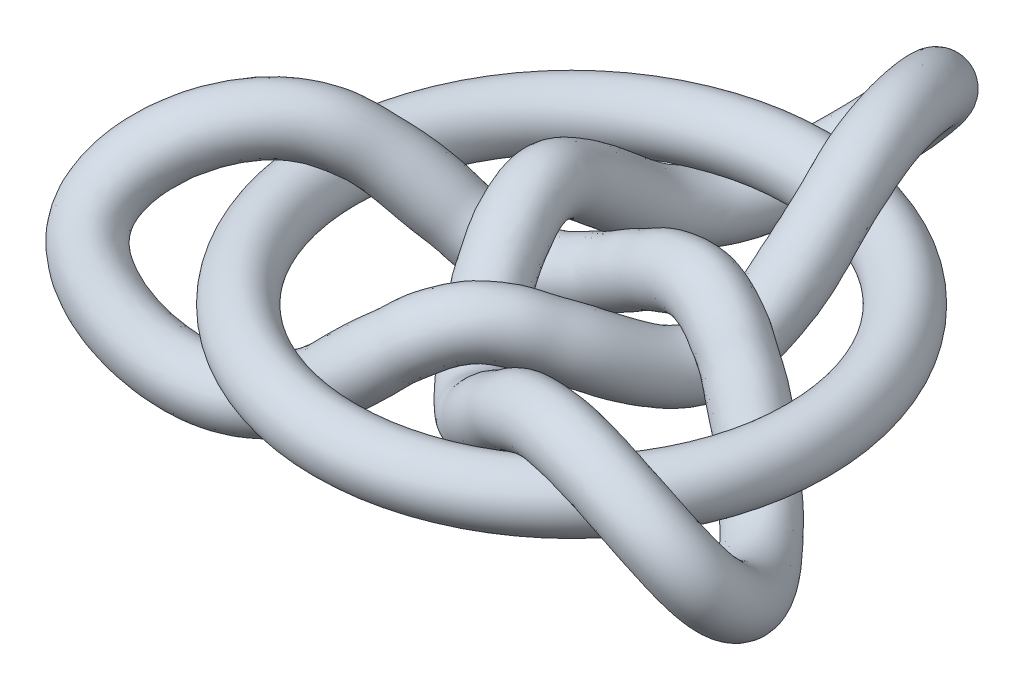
ISO-10303-21;
HEADER;
FILE_DESCRIPTION(('STEP AP214'),'2;1');
FILE_NAME('part.step','',(''),(''),'','','');
FILE_SCHEMA(('AUTOMOTIVE_DESIGN { 1 0 10303 214 1 1 1 1 }'));
ENDSEC;
DATA;
#1=APPLICATION_CONTEXT('core data for automotive mechanical design processes');
#2=APPLICATION_PROTOCOL_DEFINITION('international standard','automotive_design',2000,#1);
#3=PRODUCT_CONTEXT('',#1,'mechanical');
#4=PRODUCT('Part','Part','',(#3));
#5=PRODUCT_RELATED_PRODUCT_CATEGORY('part','',(#4));
#6=PRODUCT_DEFINITION_FORMATION('','',#4);
#7=PRODUCT_DEFINITION_CONTEXT('part definition',#1,'design');
#8=PRODUCT_DEFINITION('design','',#6,#7);
#9=PRODUCT_DEFINITION_SHAPE('','',#8);
#10=(LENGTH_UNIT() NAMED_UNIT(*) SI_UNIT(.MILLI.,.METRE.));
#11=(NAMED_UNIT(*) PLANE_ANGLE_UNIT() SI_UNIT($,.RADIAN.));
#12=(NAMED_UNIT(*) SI_UNIT($,.STERADIAN.) SOLID_ANGLE_UNIT());
#13=UNCERTAINTY_MEASURE_WITH_UNIT(LENGTH_MEASURE(1.E-05),#10,'distance_accuracy_value','');
#14=(GEOMETRIC_REPRESENTATION_CONTEXT(3) GLOBAL_UNCERTAINTY_ASSIGNED_CONTEXT((#13)) GLOBAL_UNIT_ASSIGNED_CONTEXT((#10,
#11,#12)) REPRESENTATION_CONTEXT('',''));
#15=CARTESIAN_POINT('',(0.,0.,0.));
#16=DIRECTION('',(0.,0.,1.));
#17=DIRECTION('',(1.,0.,0.));
#18=AXIS2_PLACEMENT_3D('',#15,#16,#17);
#19=CARTESIAN_POINT('',(-5.78317445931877,4.77544690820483,-90.));
#20=CARTESIAN_POINT('',(-6.54026979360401,3.86759744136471,-90.1719549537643));
#21=CARTESIAN_POINT('',(-7.34939178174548,2.87954560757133,-90.0041318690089));
#22=CARTESIAN_POINT('',(-8.9027327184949,1.00105680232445,-89.4780763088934));
#23=CARTESIAN_POINT('',(-10.4554480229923,-0.859075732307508,-88.7512559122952));
#24=CARTESIAN_POINT('',(-13.1577946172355,-4.04046610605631,-86.5440080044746));
#25=CARTESIAN_POINT('',(-16.2614282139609,-7.56209969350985,-82.9286666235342));
#26=CARTESIAN_POINT('',(-19.6062399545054,-11.096057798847,-77.693786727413));
#27=CARTESIAN_POINT('',(-22.647335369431,-13.8611111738,-71.5861692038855));
#28=CARTESIAN_POINT('',(-25.228354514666,-15.3332727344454,-65.1057590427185));
#29=CARTESIAN_POINT('',(-26.6872637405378,-15.4814034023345,-60.6542406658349));
#30=CARTESIAN_POINT('',(-27.8128284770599,-14.789134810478,-56.8704239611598));
#31=CARTESIAN_POINT('',(-28.403592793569,-13.9587503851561,-54.6856593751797));
#32=CARTESIAN_POINT('',(-29.382691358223,-10.534334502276,-49.0173939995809));
#33=CARTESIAN_POINT('',(-28.1920485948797,-2.66640595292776,-42.9182700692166));
#34=CARTESIAN_POINT('',(-30.6035791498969,4.75952668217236,-31.2341334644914));
#35=CARTESIAN_POINT('',(-24.804398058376,13.8802623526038,-23.2817341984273));
#36=CARTESIAN_POINT('',(-22.330432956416,15.7141104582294,-15.3277009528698));
#37=CARTESIAN_POINT('',(-20.8281982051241,15.7550138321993,-9.33528087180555));
#38=CARTESIAN_POINT('',(-19.6476797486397,14.514697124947,-3.2678712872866));
#39=CARTESIAN_POINT('',(-18.3664531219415,11.181940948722,4.24957073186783));
#40=CARTESIAN_POINT('',(-19.6278718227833,5.81649513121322,9.06758296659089));
#41=CARTESIAN_POINT('',(-19.4039848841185,1.19264514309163,11.4563412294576));
#42=CARTESIAN_POINT('',(-18.4364212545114,-2.89109534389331,12.7503239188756));
#43=CARTESIAN_POINT('',(-15.4678514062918,-8.79889024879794,14.2252536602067));
#44=CARTESIAN_POINT('',(-10.5237098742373,-12.49981550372,17.3599570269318));
#45=CARTESIAN_POINT('',(-5.87457109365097,-14.9640304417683,21.4847846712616));
#46=CARTESIAN_POINT('',(-2.01487585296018,-15.5971092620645,25.1010900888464));
#47=CARTESIAN_POINT('',(1.63333299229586,-15.2681101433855,28.8016541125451));
#48=CARTESIAN_POINT('',(5.25053469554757,-13.4083700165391,33.0439623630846));
#49=CARTESIAN_POINT('',(9.76043177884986,-9.98962793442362,37.4789671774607));
#50=CARTESIAN_POINT('',(11.4700392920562,-2.33890414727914,42.9095312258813));
#51=CARTESIAN_POINT('',(20.0540372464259,1.3723461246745,45.7554332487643));
#52=CARTESIAN_POINT('',(23.2016424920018,12.9369931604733,49.4139994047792));
#53=CARTESIAN_POINT('',(30.8798994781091,16.9937700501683,51.2295594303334));
#54=CARTESIAN_POINT('',(37.9868037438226,18.7214395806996,53.0186297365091));
#55=CARTESIAN_POINT('',(45.0575846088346,18.9066914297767,54.7616305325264));
#56=CARTESIAN_POINT('',(54.3198132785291,16.3342222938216,56.4220568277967));
#57=CARTESIAN_POINT('',(62.0368165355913,12.3900822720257,56.9584316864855));
#58=CARTESIAN_POINT('',(67.5152719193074,8.62858068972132,56.6411274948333));
#59=CARTESIAN_POINT('',(71.201928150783,5.58733995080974,56.0022565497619));
#60=CARTESIAN_POINT('',(74.380855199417,2.35122882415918,54.907286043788));
#61=CARTESIAN_POINT('',(76.8244521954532,-0.938245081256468,53.3392443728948));
#62=CARTESIAN_POINT('',(78.0044170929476,-3.33496898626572,51.8300851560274));
#63=CARTESIAN_POINT('',(78.7973177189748,-5.71163264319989,50.1158388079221));
#64=CARTESIAN_POINT('',(79.1722946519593,-8.18459795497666,48.073837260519));
#65=CARTESIAN_POINT('',(78.6445164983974,-11.3881437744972,44.8400145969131));
#66=CARTESIAN_POINT('',(77.1053222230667,-14.5666623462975,40.9882495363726));
#67=CARTESIAN_POINT('',(74.398723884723,-17.512283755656,36.523387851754));
#68=CARTESIAN_POINT('',(70.5183203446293,-19.9405670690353,31.4875522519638));
#69=CARTESIAN_POINT('',(65.5518720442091,-21.6701374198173,25.8108530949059));
#70=CARTESIAN_POINT('',(59.9905518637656,-22.2625766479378,19.970922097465));
#71=CARTESIAN_POINT('',(55.6813729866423,-21.5124011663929,15.6340562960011));
#72=CARTESIAN_POINT('',(51.5626836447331,-20.2768972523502,11.5367083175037));
#73=CARTESIAN_POINT('',(46.4151656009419,-18.0279599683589,6.48666278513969));
#74=CARTESIAN_POINT('',(40.8256065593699,-13.3447160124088,-4.09538779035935));
#75=CARTESIAN_POINT('',(32.9729858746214,-6.37826615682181,-4.5976867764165));
#76=CARTESIAN_POINT('',(30.2462316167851,-2.65111398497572,-11.6095227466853));
#77=CARTESIAN_POINT('',(27.1636182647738,0.00969882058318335,-13.4692124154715));
#78=CARTESIAN_POINT('',(24.405410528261,1.37475943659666,-14.9792853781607));
#79=CARTESIAN_POINT('',(22.5864666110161,1.78097473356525,-15.7128913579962));
#80=CARTESIAN_POINT('',(20.1840698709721,1.71096135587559,-16.2365846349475));
#81=CARTESIAN_POINT('',(16.5498178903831,0.612691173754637,-16.191112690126));
#82=CARTESIAN_POINT('',(10.6846490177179,-3.1721187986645,-15.1394835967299));
#83=CARTESIAN_POINT('',(2.70561119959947,-4.89475666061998,-8.25797591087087));
#84=CARTESIAN_POINT('',(-7.39478141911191,-1.95168559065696,-6.96297383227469));
#85=CARTESIAN_POINT('',(-14.2063781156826,-3.23782526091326,-7.45950863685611));
#86=CARTESIAN_POINT('',(-17.9088441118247,-3.27436481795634,-7.1801644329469));
#87=CARTESIAN_POINT('',(-20.3246838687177,-3.28006634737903,-6.6075093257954));
#88=CARTESIAN_POINT('',(-22.163142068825,-3.19772304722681,-5.9340667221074));
#89=CARTESIAN_POINT('',(-25.2932549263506,-2.53162309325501,-4.5749226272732));
#90=CARTESIAN_POINT('',(-28.7409540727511,-0.783216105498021,-2.60584503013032));
#91=CARTESIAN_POINT('',(-36.0994715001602,-0.859884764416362,1.72887925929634));
#92=CARTESIAN_POINT('',(-40.2394568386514,8.15112018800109,4.29128618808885));
#93=CARTESIAN_POINT('',(-49.6901365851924,9.39826103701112,10.1048695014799));
#94=CARTESIAN_POINT('',(-53.6724274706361,11.1426094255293,13.3800513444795));
#95=CARTESIAN_POINT('',(-56.5330219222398,12.1041771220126,16.3870169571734));
#96=CARTESIAN_POINT('',(-59.3149491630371,12.6954182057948,19.8564803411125));
#97=CARTESIAN_POINT('',(-63.103474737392,12.4731602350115,25.1365740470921));
#98=CARTESIAN_POINT('',(-66.3907227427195,11.4158917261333,30.3869009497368));
#99=CARTESIAN_POINT('',(-68.8904625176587,9.88716036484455,34.9580416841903));
#100=CARTESIAN_POINT('',(-70.5222549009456,8.04733329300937,38.7202585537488));
#101=CARTESIAN_POINT('',(-71.3275107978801,6.20920252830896,41.5812634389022));
#102=CARTESIAN_POINT('',(-71.5000780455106,4.57259371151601,43.6332653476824));
#103=CARTESIAN_POINT('',(-71.2843123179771,3.55265701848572,44.6650163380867));
#104=CARTESIAN_POINT('',(-70.9169368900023,2.59998565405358,45.5247337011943));
#105=CARTESIAN_POINT('',(-70.3869683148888,1.64699517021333,46.2863316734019));
#106=CARTESIAN_POINT('',(-68.9980554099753,-0.00424176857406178,47.3866711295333));
#107=CARTESIAN_POINT('',(-66.8348253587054,-1.87115686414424,48.3954624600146));
#108=CARTESIAN_POINT('',(-64.0181450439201,-3.77388633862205,49.2420172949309));
#109=CARTESIAN_POINT('',(-59.552298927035,-6.19936103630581,50.1200589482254));
#110=CARTESIAN_POINT('',(-53.0090236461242,-8.79900235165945,50.6581219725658));
#111=CARTESIAN_POINT('',(-45.2993584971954,-10.3175293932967,50.4262692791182));
#112=CARTESIAN_POINT('',(-40.0801780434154,-10.2303526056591,49.4771504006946));
#113=CARTESIAN_POINT('',(-35.0198657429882,-8.87933125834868,48.2318727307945));
#114=CARTESIAN_POINT('',(-29.5884526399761,-5.428387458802,46.5255766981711));
#115=CARTESIAN_POINT('',(-25.2062151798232,-0.58172023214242,37.134409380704));
#116=CARTESIAN_POINT('',(-18.4876854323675,5.9184288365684,36.9333736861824));
#117=CARTESIAN_POINT('',(-14.5327769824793,8.27274945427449,29.1036178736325));
#118=CARTESIAN_POINT('',(-10.2532158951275,10.6717754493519,25.5083524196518));
#119=CARTESIAN_POINT('',(-7.16497891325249,11.4187178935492,22.0789523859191));
#120=CARTESIAN_POINT('',(-4.2757298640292,11.6880072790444,19.1752104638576));
#121=CARTESIAN_POINT('',(-1.29722604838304,11.5721980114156,16.2742364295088));
#122=CARTESIAN_POINT('',(2.44368587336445,10.5195565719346,12.1419049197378));
#123=CARTESIAN_POINT('',(9.29171114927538,9.59506591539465,8.20686027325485));
#124=CARTESIAN_POINT('',(13.7545695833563,5.55308804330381,1.71028517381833));
#125=CARTESIAN_POINT('',(14.8138842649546,0.636757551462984,-4.9289872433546));
#126=CARTESIAN_POINT('',(18.6192234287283,-0.461737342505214,-9.26422371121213));
#127=CARTESIAN_POINT('',(19.7047921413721,-0.789444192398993,-11.1730096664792));
#128=CARTESIAN_POINT('',(20.1756820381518,-0.855752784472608,-12.593741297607));
#129=CARTESIAN_POINT('',(20.4194918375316,-0.722202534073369,-13.9588721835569));
#130=CARTESIAN_POINT('',(20.7934703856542,0.264352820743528,-17.3454872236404));
#131=CARTESIAN_POINT('',(17.535551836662,2.16828724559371,-25.8819460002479));
#132=CARTESIAN_POINT('',(19.5432902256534,12.3693218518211,-34.4102259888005));
#133=CARTESIAN_POINT('',(15.3123256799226,15.3629220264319,-45.7563546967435));
#134=CARTESIAN_POINT('',(13.7815939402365,16.8979433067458,-51.9247829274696));
#135=CARTESIAN_POINT('',(12.6234598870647,17.8073759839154,-56.115845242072));
#136=CARTESIAN_POINT('',(11.3174138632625,18.5952924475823,-60.4624271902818));
#137=CARTESIAN_POINT('',(9.07502098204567,18.4885218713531,-67.1486819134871));
#138=CARTESIAN_POINT('',(6.5205754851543,17.4164860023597,-73.8625958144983));
#139=CARTESIAN_POINT('',(3.74719891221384,15.3431364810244,-80.0279396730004));
#140=CARTESIAN_POINT('',(1.08166524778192,12.7039157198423,-84.4894619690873));
#141=CARTESIAN_POINT('',(-1.35018180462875,10.0052185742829,-87.3987353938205));
#142=CARTESIAN_POINT('',(-2.79785005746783,8.3039454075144,-88.3378968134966));
#143=CARTESIAN_POINT('',(-4.25866130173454,6.58570768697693,-89.3021510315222));
#144=CARTESIAN_POINT('',(-5.0260791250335,5.68329637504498,-89.8280450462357));
#145=CARTESIAN_POINT('',(-5.78317445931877,4.77544690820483,-90.));
#146=CARTESIAN_POINT('',(-5.78317445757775,4.77544691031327,-75.));
#147=CARTESIAN_POINT('',(-5.98320306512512,5.08700653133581,-75.1606534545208));
#148=CARTESIAN_POINT('',(-5.91850886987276,5.13174211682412,-75.187293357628));
#149=CARTESIAN_POINT('',(-6.14304283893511,5.19750181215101,-75.2975712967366));
#150=CARTESIAN_POINT('',(-6.69762398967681,5.23442045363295,-75.4519064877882));
#151=CARTESIAN_POINT('',(-8.38325780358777,4.4538768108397,-75.0004495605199));
#152=CARTESIAN_POINT('',(-11.2469134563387,3.09943238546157,-73.4682040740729));
#153=CARTESIAN_POINT('',(-15.0553712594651,1.45662892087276,-70.6298743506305));
#154=CARTESIAN_POINT('',(-18.8304329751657,0.0439193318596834,-67.1422455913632));
#155=CARTESIAN_POINT('',(-21.829367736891,-0.683229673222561,-63.4464478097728));
#156=CARTESIAN_POINT('',(-23.4963923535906,-0.832368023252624,-61.4513614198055));
#157=CARTESIAN_POINT('',(-24.1892045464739,-0.452003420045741,-59.6563777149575));
#158=CARTESIAN_POINT('',(-24.1971420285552,0.0351328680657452,-58.5555234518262));
#159=CARTESIAN_POINT('',(-22.5978031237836,1.66682004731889,-54.8806220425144));
#160=CARTESIAN_POINT('',(-15.0261296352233,4.16170641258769,-47.5318808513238));
#161=CARTESIAN_POINT('',(-21.3276177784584,14.4439909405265,-39.4102238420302));
#162=CARTESIAN_POINT('',(-9.78382416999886,15.89025087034,-26.3529653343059));
#163=CARTESIAN_POINT('',(-7.7880575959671,16.3903254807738,-19.2457144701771));
#164=CARTESIAN_POINT('',(-6.5582051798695,16.72849494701,-13.5952829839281));
#165=CARTESIAN_POINT('',(-5.56701901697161,17.0157592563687,-7.58907889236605));
#166=CARTESIAN_POINT('',(-4.07169286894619,16.7937878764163,0.759239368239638));
#167=CARTESIAN_POINT('',(-9.21128230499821,17.1955407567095,10.7832255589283));
#168=CARTESIAN_POINT('',(-13.699154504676,14.2592967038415,16.7646207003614));
#169=CARTESIAN_POINT('',(-17.5547885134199,9.87460739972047,20.6747051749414));
#170=CARTESIAN_POINT('',(-21.8441364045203,1.10157240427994,24.849741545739));
#171=CARTESIAN_POINT('',(-19.4887585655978,-6.3512811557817,27.6380177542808));
#172=CARTESIAN_POINT('',(-15.8934241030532,-10.4318109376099,31.7187769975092));
#173=CARTESIAN_POINT('',(-12.4068144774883,-11.7070355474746,35.243158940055));
#174=CARTESIAN_POINT('',(-8.98973329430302,-11.4094838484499,38.6466886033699));
#175=CARTESIAN_POINT('',(-5.49141593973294,-8.47951682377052,42.1246580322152));
#176=CARTESIAN_POINT('',(-1.5013925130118,-4.049182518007,46.2768773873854));
#177=CARTESIAN_POINT('',(0.598166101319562,8.88437991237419,43.4514610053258));
#178=CARTESIAN_POINT('',(8.57610079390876,10.1072411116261,52.5283266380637));
#179=CARTESIAN_POINT('',(16.2469854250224,26.4523734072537,43.73408069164));
#180=CARTESIAN_POINT('',(26.8165337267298,30.70708646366,46.244856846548));
#181=CARTESIAN_POINT('',(36.8172010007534,32.9915009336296,48.9021605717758));
#182=CARTESIAN_POINT('',(46.6164467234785,33.7393922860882,51.7667035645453));
#183=CARTESIAN_POINT('',(58.1649151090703,30.9548013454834,55.9626862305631));
#184=CARTESIAN_POINT('',(67.9538091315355,26.1703687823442,58.7199405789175));
#185=CARTESIAN_POINT('',(75.2638126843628,21.1351503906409,59.784077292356));
#186=CARTESIAN_POINT('',(80.4979987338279,16.7979716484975,59.8292979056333));
#187=CARTESIAN_POINT('',(85.4244109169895,11.8000989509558,58.9211807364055));
#188=CARTESIAN_POINT('',(89.644715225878,6.24701200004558,56.9006008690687));
#189=CARTESIAN_POINT('',(91.9096620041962,1.7854007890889,54.4121359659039));
#190=CARTESIAN_POINT('',(93.4737359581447,-2.64862043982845,51.5536160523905));
#191=CARTESIAN_POINT('',(94.2599339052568,-7.24467174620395,48.1377961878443));
#192=CARTESIAN_POINT('',(93.5690167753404,-12.8354269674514,43.3072463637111));
#193=CARTESIAN_POINT('',(91.4463663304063,-18.2161180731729,38.118371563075));
#194=CARTESIAN_POINT('',(87.8017737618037,-23.2498205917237,32.6987242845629));
#195=CARTESIAN_POINT('',(82.6000800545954,-27.7551501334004,26.998628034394));
#196=CARTESIAN_POINT('',(75.8005388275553,-31.4688779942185,20.6661676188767));
#197=CARTESIAN_POINT('',(68.0158005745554,-33.5799970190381,13.8959695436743));
#198=CARTESIAN_POINT('',(61.5350739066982,-33.1734767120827,8.24870035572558));
#199=CARTESIAN_POINT('',(55.6253352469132,-31.6506801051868,2.48292792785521));
#200=CARTESIAN_POINT('',(48.8452868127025,-28.0208821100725,-5.32257467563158));
#201=CARTESIAN_POINT('',(49.0622263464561,-14.0559527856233,-17.359636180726));
#202=CARTESIAN_POINT('',(35.9008408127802,-12.1610548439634,-19.2271963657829));
#203=CARTESIAN_POINT('',(38.3286033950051,0.461216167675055,-24.3927691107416));
#204=CARTESIAN_POINT('',(34.228972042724,5.0006581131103,-25.6625580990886));
#205=CARTESIAN_POINT('',(30.1035271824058,8.21721160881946,-27.1635323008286));
#206=CARTESIAN_POINT('',(26.3387604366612,9.32014425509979,-28.1689363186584));
#207=CARTESIAN_POINT('',(21.9369714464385,9.12883114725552,-29.2069739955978));
#208=CARTESIAN_POINT('',(16.7724939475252,5.8816392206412,-30.1713616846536));
#209=CARTESIAN_POINT('',(11.3093283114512,-1.97421993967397,-31.2184518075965));
#210=CARTESIAN_POINT('',(9.33714720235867,-16.8919610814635,-19.4535970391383));
#211=CARTESIAN_POINT('',(0.0441535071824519,-15.7082666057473,-3.0009840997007));
#212=CARTESIAN_POINT('',(-8.68518834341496,-14.9410891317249,-0.0382104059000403));
#213=CARTESIAN_POINT('',(-14.0850723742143,-14.524205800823,2.0471363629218));
#214=CARTESIAN_POINT('',(-18.5332425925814,-14.4935764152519,3.25413933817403));
#215=CARTESIAN_POINT('',(-22.3653397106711,-14.5083399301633,4.05190986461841));
#216=CARTESIAN_POINT('',(-27.7742209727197,-13.703934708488,5.03200979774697));
#217=CARTESIAN_POINT('',(-33.1337581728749,-12.3132382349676,6.67927583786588));
#218=CARTESIAN_POINT('',(-46.6903612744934,-12.8181041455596,2.60604762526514));
#219=CARTESIAN_POINT('',(-47.039295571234,-3.86736377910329,11.583139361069));
#220=CARTESIAN_POINT('',(-60.1472641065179,-1.76048563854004,7.16402568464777));
#221=CARTESIAN_POINT('',(-62.906148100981,0.127967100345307,8.84442956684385));
#222=CARTESIAN_POINT('',(-64.4742315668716,0.705448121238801,10.8472610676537));
#223=CARTESIAN_POINT('',(-65.6844511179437,0.563560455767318,13.5010942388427));
#224=CARTESIAN_POINT('',(-67.3513743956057,-0.269922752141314,18.3392585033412));
#225=CARTESIAN_POINT('',(-68.3561098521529,-1.66341147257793,23.2002700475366));
#226=CARTESIAN_POINT('',(-68.7932172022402,-3.0643098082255,27.2966693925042));
#227=CARTESIAN_POINT('',(-68.7286784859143,-4.28187664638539,30.291461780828));
#228=CARTESIAN_POINT('',(-68.3184788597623,-5.03686101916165,32.0612088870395));
#229=CARTESIAN_POINT('',(-67.7834888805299,-5.2200903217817,32.8132848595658));
#230=CARTESIAN_POINT('',(-67.546677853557,-4.80171749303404,32.7427574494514));
#231=CARTESIAN_POINT('',(-67.450977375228,-4.32153460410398,32.652296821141));
#232=CARTESIAN_POINT('',(-67.4289987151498,-3.80082610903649,32.5609061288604));
#233=CARTESIAN_POINT('',(-66.8481267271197,-3.70035038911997,32.9674263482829));
#234=CARTESIAN_POINT('',(-65.4265626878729,-3.97308530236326,33.5780988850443));
#235=CARTESIAN_POINT('',(-63.1943552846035,-4.38116902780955,34.2495383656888));
#236=CARTESIAN_POINT('',(-59.3785163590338,-4.80556273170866,35.1204164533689));
#237=CARTESIAN_POINT('',(-53.6399414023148,-4.94977275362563,36.0709406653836));
#238=CARTESIAN_POINT('',(-47.4496197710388,-4.0967776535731,36.8048645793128));
#239=CARTESIAN_POINT('',(-44.0411122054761,-3.68714693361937,36.6798184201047));
#240=CARTESIAN_POINT('',(-41.1042860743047,-2.70280007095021,35.8989508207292));
#241=CARTESIAN_POINT('',(-38.2896001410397,-0.540096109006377,33.7651603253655));
#242=CARTESIAN_POINT('',(-26.3611407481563,-7.37935457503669,22.7760959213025));
#243=CARTESIAN_POINT('',(-24.8234705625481,3.46973002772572,22.8240768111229));
#244=CARTESIAN_POINT('',(-14.9696209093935,-1.8783487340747,17.3754012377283));
#245=CARTESIAN_POINT('',(-11.7865339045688,-0.952549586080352,16.105680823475));
#246=CARTESIAN_POINT('',(-10.0665840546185,-1.90075005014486,15.4813424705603));
#247=CARTESIAN_POINT('',(-9.3433816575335,-1.73924035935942,14.7425013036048));
#248=CARTESIAN_POINT('',(-8.92710438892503,-1.19253527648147,13.6501599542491));
#249=CARTESIAN_POINT('',(-7.71131566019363,-1.00719887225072,10.3590968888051));
#250=CARTESIAN_POINT('',(-3.8773927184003,4.42129743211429,2.59877033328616));
#251=CARTESIAN_POINT('',(-0.489745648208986,1.48657243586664,-3.55341043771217));
#252=CARTESIAN_POINT('',(1.48152856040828,-6.27589436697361,-7.04607460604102));
#253=CARTESIAN_POINT('',(4.44996996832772,-3.54117471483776,-13.4012472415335));
#254=CARTESIAN_POINT('',(5.43304028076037,-2.92675598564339,-15.2929285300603));
#255=CARTESIAN_POINT('',(5.90397926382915,-2.87249357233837,-16.6859425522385));
#256=CARTESIAN_POINT('',(6.16930086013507,-2.98551842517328,-18.011436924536));
#257=CARTESIAN_POINT('',(6.39429174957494,-2.98419682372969,-21.2565319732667));
#258=CARTESIAN_POINT('',(9.29345548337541,-8.15786570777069,-34.4924982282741));
#259=CARTESIAN_POINT('',(6.98515335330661,4.86743110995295,-39.6351783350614));
#260=CARTESIAN_POINT('',(10.7544198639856,1.92605357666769,-52.1474088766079));
#261=CARTESIAN_POINT('',(11.0195427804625,2.45593271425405,-55.2442045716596));
#262=CARTESIAN_POINT('',(10.309494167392,3.01395950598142,-57.1927436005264));
#263=CARTESIAN_POINT('',(8.80316538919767,3.73777499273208,-59.1047616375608));
#264=CARTESIAN_POINT('',(6.12448592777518,4.287987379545,-62.991668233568));
#265=CARTESIAN_POINT('',(2.82678781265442,4.45142455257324,-67.0459958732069));
#266=CARTESIAN_POINT('',(-0.44998429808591,4.18438720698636,-70.7508362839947));
#267=CARTESIAN_POINT('',(-2.84624297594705,3.61225756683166,-73.0727082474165));
#268=CARTESIAN_POINT('',(-4.40983951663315,3.39169947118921,-74.1827268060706));
#269=CARTESIAN_POINT('',(-4.57883025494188,3.33325239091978,-74.2304116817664));
#270=CARTESIAN_POINT('',(-5.10192146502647,3.8598457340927,-74.5314492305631));
#271=CARTESIAN_POINT('',(-5.58314585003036,4.46388728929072,-74.8393465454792));
#272=CARTESIAN_POINT('',(-5.78317445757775,4.77544691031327,-75.));
#273=CARTESIAN_POINT('',(5.78317446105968,-4.77544690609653,-75.));
#274=CARTESIAN_POINT('',(5.56474111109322,-4.50419613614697,-74.8167435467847));
#275=CARTESIAN_POINT('',(5.6519768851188,-4.41578865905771,-74.8565877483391));
#276=CARTESIAN_POINT('',(5.48257383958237,-4.25899342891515,-74.7537506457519));
#277=CARTESIAN_POINT('',(4.99551221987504,-4.12167830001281,-74.4761580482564));
#278=CARTESIAN_POINT('',(3.54953098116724,-4.49987136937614,-73.3438396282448));
#279=CARTESIAN_POINT('',(1.11647278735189,-5.04029263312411,-70.8532049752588));
#280=CARTESIAN_POINT('',(-2.1031890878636,-5.2789438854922,-67.0041129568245));
#281=CARTESIAN_POINT('',(-5.36631966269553,-5.03313003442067,-62.8158151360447));
#282=CARTESIAN_POINT('',(-8.01405015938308,-4.41532624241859,-58.8270589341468));
#283=CARTESIAN_POINT('',(-9.5196598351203,-3.61630494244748,-56.8709324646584));
#284=CARTESIAN_POINT('',(-10.1294664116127,-3.12589488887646,-55.0966141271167));
#285=CARTESIAN_POINT('',(-10.1182055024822,-2.95761146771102,-53.9974734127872));
#286=CARTESIAN_POINT('',(-9.40503366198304,-3.1564713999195,-49.692282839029));
#287=CARTESIAN_POINT('',(-6.82406719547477,-5.79383678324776,-38.8966944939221));
#288=CARTESIAN_POINT('',(-8.66862802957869,7.11827379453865,-33.7963960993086));
#289=CARTESIAN_POINT('',(-6.34873088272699,1.92225649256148,-19.5034419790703));
#290=CARTESIAN_POINT('',(-6.58557940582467,1.38043041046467,-17.3462158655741));
#291=CARTESIAN_POINT('',(-6.00644441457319,1.79306825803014,-15.3618377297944));
#292=CARTESIAN_POINT('',(-4.69433743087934,2.95761072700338,-12.9924388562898));
#293=CARTESIAN_POINT('',(-1.0202586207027,3.82046508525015,-7.65979858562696));
#294=CARTESIAN_POINT('',(0.461298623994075,9.79139067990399,1.15596317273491));
#295=CARTESIAN_POINT('',(-1.21016238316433,12.2417790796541,8.3105506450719));
#296=CARTESIAN_POINT('',(-4.20151626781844,12.8602927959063,14.3868440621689));
#297=CARTESIAN_POINT('',(-9.7103216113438,11.1274622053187,22.7929090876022));
#298=CARTESIAN_POINT('',(-11.0566641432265,6.04680109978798,27.57466956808));
#299=CARTESIAN_POINT('',(-10.1358823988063,3.60563197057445,31.171130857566));
#300=CARTESIAN_POINT('',(-9.35152070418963,2.83973780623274,32.8153798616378));
#301=CARTESIAN_POINT('',(-8.20863518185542,2.94442961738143,33.9099461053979));
#302=CARTESIAN_POINT('',(-6.12274164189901,4.40578418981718,34.3912063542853));
#303=CARTESIAN_POINT('',(-3.36201199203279,7.52540427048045,36.10495652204));
#304=CARTESIAN_POINT('',(4.83947915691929,13.6835305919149,29.1612006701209));
#305=CARTESIAN_POINT('',(7.40495345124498,18.8345083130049,39.2588130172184));
#306=CARTESIAN_POINT('',(23.7057301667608,24.2303944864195,29.546538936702));
#307=CARTESIAN_POINT('',(32.1957744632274,27.2112177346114,32.6352214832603));
#308=CARTESIAN_POINT('',(40.6212120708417,29.2354275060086,34.9960426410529));
#309=CARTESIAN_POINT('',(49.1308105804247,30.4275531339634,37.2491082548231));
#310=CARTESIAN_POINT('',(59.5964660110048,30.0201060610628,40.9786313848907));
#311=CARTESIAN_POINT('',(68.9881399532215,27.5697711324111,43.76973516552));
#312=CARTESIAN_POINT('',(76.0096104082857,24.3161696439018,45.1240940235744));
#313=CARTESIAN_POINT('',(80.9640150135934,21.2391666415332,45.4881509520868));
#314=CARTESIAN_POINT('',(85.4911253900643,17.5076985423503,45.0246702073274));
#315=CARTESIAN_POINT('',(89.250347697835,13.2790793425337,43.6196309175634));
#316=CARTESIAN_POINT('',(91.2188427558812,9.89890037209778,41.8013300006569));
#317=CARTESIAN_POINT('',(92.6634565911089,6.50619088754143,39.6784093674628));
#318=CARTESIAN_POINT('',(93.5553219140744,2.94359818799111,37.1064541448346));
#319=CARTESIAN_POINT('',(93.5532214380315,-1.65238946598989,33.2758857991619));
#320=CARTESIAN_POINT('',(92.5517899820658,-6.37833827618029,28.9271454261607));
#321=CARTESIAN_POINT('',(90.4466952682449,-11.204396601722,24.0953445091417));
#322=CARTESIAN_POINT('',(87.079942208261,-16.0045274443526,18.7438000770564));
#323=CARTESIAN_POINT('',(82.2350037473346,-20.4677479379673,12.6744113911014));
#324=CARTESIAN_POINT('',(76.1606847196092,-23.5137867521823,6.16477544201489));
#325=CARTESIAN_POINT('',(70.83965558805,-23.9260065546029,1.08170347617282));
#326=CARTESIAN_POINT('',(65.8825247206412,-22.7364569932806,-4.00075011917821));
#327=CARTESIAN_POINT('',(60.0169929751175,-18.6768146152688,-10.7425975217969));
#328=CARTESIAN_POINT('',(57.6897742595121,-1.9337304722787,-12.6325959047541));
#329=CARTESIAN_POINT('',(47.3110372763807,-1.13884870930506,-21.3274984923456));
#330=CARTESIAN_POINT('',(44.4675812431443,12.8677928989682,-17.5325970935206));
#331=CARTESIAN_POINT('',(38.2081947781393,17.4267993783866,-18.3531191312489));
#332=CARTESIAN_POINT('',(31.4767262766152,21.1636671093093,-19.4653285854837));
#333=CARTESIAN_POINT('',(25.2785040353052,22.3101479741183,-20.653301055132));
#334=CARTESIAN_POINT('',(18.3927958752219,22.1310826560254,-22.4441745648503));
#335=CARTESIAN_POINT('',(11.1823334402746,18.9066852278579,-25.4588264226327));
#336=CARTESIAN_POINT('',(3.84395915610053,12.3130964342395,-30.4667618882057));
#337=CARTESIAN_POINT('',(3.92592422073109,-7.1024477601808,-33.1740071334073));
#338=CARTESIAN_POINT('',(0.929789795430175,-19.7479742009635,-18.6023114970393));
#339=CARTESIAN_POINT('',(-7.78190123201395,-22.7158669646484,-12.7888801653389));
#340=CARTESIAN_POINT('',(-15.0913439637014,-24.399650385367,-9.30290281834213));
#341=CARTESIAN_POINT('',(-21.9965531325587,-24.485396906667,-7.44099006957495));
#342=CARTESIAN_POINT('',(-28.2230847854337,-23.8088682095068,-6.3403271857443));
#343=CARTESIAN_POINT('',(-35.4941946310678,-21.0862274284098,-5.44713958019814));
#344=CARTESIAN_POINT('',(-42.2833338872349,-17.8511547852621,-4.4679226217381));
#345=CARTESIAN_POINT('',(-51.847652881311,-9.36400843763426,-12.1474094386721));
#346=CARTESIAN_POINT('',(-56.8392290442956,-5.60239444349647,-0.46319746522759));
#347=CARTESIAN_POINT('',(-64.7690994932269,6.15484472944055,-5.49243441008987));
#348=CARTESIAN_POINT('',(-68.9438793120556,9.48231964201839,-1.32594432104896));
#349=CARTESIAN_POINT('',(-72.0754992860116,10.2744260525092,2.17434822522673));
#350=CARTESIAN_POINT('',(-75.1804666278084,9.63166707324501,5.99880823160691));
#351=CARTESIAN_POINT('',(-78.6824760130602,7.12290156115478,11.6961126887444));
#352=CARTESIAN_POINT('',(-81.0909443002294,3.63531652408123,17.146818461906));
#353=CARTESIAN_POINT('',(-82.4544052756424,0.140512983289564,21.824066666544));
#354=CARTESIAN_POINT('',(-82.9999854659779,-3.08099833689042,25.6363006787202));
#355=CARTESIAN_POINT('',(-82.936485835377,-5.8620160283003,28.547419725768));
#356=CARTESIAN_POINT('',(-82.423173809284,-8.1843517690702,30.6631316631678));
#357=CARTESIAN_POINT('',(-81.7623526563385,-9.63857757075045,31.7692144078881));
#358=CARTESIAN_POINT('',(-80.9351544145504,-10.9650675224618,32.652181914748));
#359=CARTESIAN_POINT('',(-79.9097428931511,-12.2503936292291,33.3857140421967));
#360=CARTESIAN_POINT('',(-77.6807660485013,-14.1019240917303,34.1120382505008));
#361=CARTESIAN_POINT('',(-74.6273046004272,-15.8466464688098,34.45036841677));
#362=CARTESIAN_POINT('',(-70.9351068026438,-17.2715769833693,34.387544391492));
#363=CARTESIAN_POINT('',(-65.3827743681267,-18.5864075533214,33.8466620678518));
#364=CARTESIAN_POINT('',(-57.6940601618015,-19.0855173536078,32.6144292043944));
#365=CARTESIAN_POINT('',(-49.4811635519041,-17.9632625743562,30.9577515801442));
#366=CARTESIAN_POINT('',(-43.6585463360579,-16.9132474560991,29.856602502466));
#367=CARTESIAN_POINT('',(-38.202882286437,-15.4358089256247,28.2849238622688));
#368=CARTESIAN_POINT('',(-32.9726508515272,-13.3353285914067,25.3551484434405));
#369=CARTESIAN_POINT('',(-14.8818633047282,-17.6878735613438,26.7498757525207));
#370=CARTESIAN_POINT('',(-15.0248903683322,-8.48847003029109,20.4876501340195));
#371=CARTESIAN_POINT('',(-3.55994778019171,-10.0191785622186,23.9556190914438));
#372=CARTESIAN_POINT('',(-1.146556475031,-8.36466146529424,23.444534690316));
#373=CARTESIAN_POINT('',(0.217242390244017,-8.55587901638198,24.1905423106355));
#374=CARTESIAN_POINT('',(0.182169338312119,-8.46780974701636,24.1663604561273));
#375=CARTESIAN_POINT('',(-0.343870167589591,-8.44631332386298,23.5226800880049));
#376=CARTESIAN_POINT('',(0.010865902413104,-9.44476326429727,20.7299677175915));
#377=CARTESIAN_POINT('',(-2.79844691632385,-7.90138087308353,11.4195816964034));
#378=CARTESIAN_POINT('',(0.0889331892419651,-11.6881137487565,5.06154921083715));
#379=CARTESIAN_POINT('',(6.20102141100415,-17.995385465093,1.52295668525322));
#380=CARTESIAN_POINT('',(6.12576881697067,-17.7799150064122,-8.52572282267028));
#381=CARTESIAN_POINT('',(6.94371168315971,-17.7397761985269,-12.8499780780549));
#382=CARTESIAN_POINT('',(7.99687096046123,-17.7301668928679,-16.6225384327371));
#383=CARTESIAN_POINT('',(9.17007757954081,-17.6002069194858,-20.3666971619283));
#384=CARTESIAN_POINT('',(11.1900585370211,-16.3016563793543,-27.7302021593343));
#385=CARTESIAN_POINT('',(22.7743173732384,-14.68777641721,-39.5059595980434));
#386=CARTESIAN_POINT('',(16.0823862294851,-4.58285749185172,-47.9070462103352));
#387=CARTESIAN_POINT('',(25.2272927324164,-0.97687117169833,-56.2500145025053));
#388=CARTESIAN_POINT('',(25.3036562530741,0.718237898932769,-59.5772801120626));
#389=CARTESIAN_POINT('',(24.4603693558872,1.14595126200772,-61.7041255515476));
#390=CARTESIAN_POINT('',(22.8097291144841,0.945832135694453,-63.8109013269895));
#391=CARTESIAN_POINT('',(19.8050013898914,0.110215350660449,-67.5913703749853));
#392=CARTESIAN_POINT('',(16.045934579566,-1.45385904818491,-71.1293409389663));
#393=CARTESIAN_POINT('',(12.2150880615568,-3.2379613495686,-73.9695696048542));
#394=CARTESIAN_POINT('',(9.37322697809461,-4.76089348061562,-75.5419140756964));
#395=CARTESIAN_POINT('',(7.50828392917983,-5.54448745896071,-75.9177950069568));
#396=CARTESIAN_POINT('',(7.19671861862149,-5.82025678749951,-75.9688752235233));
#397=CARTESIAN_POINT('',(6.54369894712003,-5.52313007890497,-75.6047052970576));
#398=CARTESIAN_POINT('',(6.00160781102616,-5.04669767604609,-75.1832564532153));
#399=CARTESIAN_POINT('',(5.78317446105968,-4.77544690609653,-75.));
#400=CARTESIAN_POINT('',(5.78317445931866,-4.77544690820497,-90.));
#401=CARTESIAN_POINT('',(5.00767438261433,-5.72360522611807,-89.8280450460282));
#402=CARTESIAN_POINT('',(4.22109397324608,-6.66798516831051,-89.67342625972));
#403=CARTESIAN_POINT('',(2.72288396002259,-8.45543843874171,-88.9342556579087));
#404=CARTESIAN_POINT('',(1.23768818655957,-10.2151744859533,-87.7755074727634));
#405=CARTESIAN_POINT('',(-1.22500583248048,-12.9942142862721,-84.8873980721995));
#406=CARTESIAN_POINT('',(-3.89804197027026,-15.7018247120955,-80.3136675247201));
#407=CARTESIAN_POINT('',(-6.65405778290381,-17.8316306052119,-74.068025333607));
#408=CARTESIAN_POINT('',(-9.18322205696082,-18.9381605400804,-67.259738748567));
#409=CARTESIAN_POINT('',(-11.413036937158,-19.0653693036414,-60.4863701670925));
#410=CARTESIAN_POINT('',(-12.7105312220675,-18.2653403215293,-56.0738117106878));
#411=CARTESIAN_POINT('',(-13.7530903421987,-17.4630262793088,-52.310660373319));
#412=CARTESIAN_POINT('',(-14.324656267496,-16.9514947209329,-50.1276093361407));
#413=CARTESIAN_POINT('',(-16.1899218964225,-15.3576259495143,-43.8290547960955));
#414=CARTESIAN_POINT('',(-19.9899861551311,-12.6219491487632,-34.2830837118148));
#415=CARTESIAN_POINT('',(-17.9445894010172,-2.56619046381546,-25.6203057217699));
#416=CARTESIAN_POINT('',(-21.3693047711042,-0.0877320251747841,-16.4322108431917));
#417=CARTESIAN_POINT('',(-21.1279547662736,0.704215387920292,-13.4282023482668));
#418=CARTESIAN_POINT('',(-20.2764374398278,0.819587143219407,-11.1018356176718));
#419=CARTESIAN_POINT('',(-18.7749981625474,0.456548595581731,-8.67123125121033));
#420=CARTESIAN_POINT('',(-15.315018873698,-1.79138184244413,-4.16946722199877));
#421=CARTESIAN_POINT('',(-9.95529089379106,-1.58765494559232,-0.55967941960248));
#422=CARTESIAN_POINT('',(-6.91499276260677,-0.824872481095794,3.00227117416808));
#423=CARTESIAN_POINT('',(-5.08314900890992,0.0945900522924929,6.46246280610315));
#424=CARTESIAN_POINT('',(-3.33403661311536,1.22699955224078,12.16842120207));
#425=CARTESIAN_POINT('',(-2.09161545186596,-0.101733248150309,17.2966088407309));
#426=CARTESIAN_POINT('',(-0.117029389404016,-0.926587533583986,20.9371385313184));
#427=CARTESIAN_POINT('',(1.04041792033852,-1.05033590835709,22.6733110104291));
#428=CARTESIAN_POINT('',(2.41443110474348,-0.914196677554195,24.0649116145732));
#429=CARTESIAN_POINT('',(4.61920899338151,-0.523069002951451,25.3105106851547));
#430=CARTESIAN_POINT('',(7.89981229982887,1.58495885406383,27.3070463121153));
#431=CARTESIAN_POINT('',(15.711352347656,2.46024653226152,28.6192708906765));
#432=CARTESIAN_POINT('',(18.8828899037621,10.0996133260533,32.485919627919));
#433=CARTESIAN_POINT('',(30.6603872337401,10.7150142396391,35.2264576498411));
#434=CARTESIAN_POINT('',(36.2591402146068,13.4979013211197,37.6199240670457));
#435=CARTESIAN_POINT('',(41.7908148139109,14.9653661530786,39.1125118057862));
#436=CARTESIAN_POINT('',(47.5719484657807,15.5948522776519,40.2440352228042));
#437=CARTESIAN_POINT('',(55.7513641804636,15.399527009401,41.4380019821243));
#438=CARTESIAN_POINT('',(63.0711473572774,13.7894846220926,42.0082262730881));
#439=CARTESIAN_POINT('',(68.2610696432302,11.8095999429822,41.9811442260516));
#440=CARTESIAN_POINT('',(71.6679444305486,10.0285349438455,41.6611095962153));
#441=CARTESIAN_POINT('',(74.4475696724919,8.05882841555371,41.01077551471));
#442=CARTESIAN_POINT('',(76.4300846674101,6.0938222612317,40.0582744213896));
#443=CARTESIAN_POINT('',(77.3135978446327,4.77853059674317,39.2192791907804));
#444=CARTESIAN_POINT('',(77.987038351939,3.44317868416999,38.2406321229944));
#445=CARTESIAN_POINT('',(78.4676826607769,2.00367197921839,37.0424952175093));
#446=CARTESIAN_POINT('',(78.6287211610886,-0.205106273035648,34.8086540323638));
#447=CARTESIAN_POINT('',(78.2107458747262,-2.72888254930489,31.7970233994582));
#448=CARTESIAN_POINT('',(77.0436453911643,-5.46685976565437,27.9200080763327));
#449=CARTESIAN_POINT('',(74.9981824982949,-8.1899443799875,23.2327242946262));
#450=CARTESIAN_POINT('',(71.9863369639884,-10.6690073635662,17.8190968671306));
#451=CARTESIAN_POINT('',(68.1354360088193,-12.196366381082,12.2397279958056));
#452=CARTESIAN_POINT('',(64.9859546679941,-12.2649310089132,8.46705941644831));
#453=CARTESIAN_POINT('',(61.8198731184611,-11.362674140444,5.05303027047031));
#454=CARTESIAN_POINT('',(57.5868717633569,-8.68389247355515,1.06663993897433));
#455=CARTESIAN_POINT('',(49.4531544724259,-1.22249369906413,0.631652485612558));
#456=CARTESIAN_POINT('',(44.3831823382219,4.6439399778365,-6.69798890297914));
#457=CARTESIAN_POINT('',(36.3852094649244,9.75546274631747,-4.74935072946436));
#458=CARTESIAN_POINT('',(31.1428410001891,12.4358400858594,-6.15977344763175));
#459=CARTESIAN_POINT('',(25.7786096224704,14.3212149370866,-7.28108166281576));
#460=CARTESIAN_POINT('',(21.5262102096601,14.7709784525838,-8.19725609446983));
#461=CARTESIAN_POINT('',(16.6398942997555,14.7132128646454,-9.47378520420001));
#462=CARTESIAN_POINT('',(10.9596573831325,13.6377371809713,-11.478577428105));
#463=CARTESIAN_POINT('',(3.21927986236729,11.1151975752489,-14.387793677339));
#464=CARTESIAN_POINT('',(-2.70561178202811,4.89475666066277,-21.97838600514));
#465=CARTESIAN_POINT('',(-6.50914513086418,-5.99139318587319,-22.5643012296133));
#466=CARTESIAN_POINT('',(-13.3030910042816,-11.0126030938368,-20.210178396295));
#467=CARTESIAN_POINT('',(-18.9151157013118,-13.1498094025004,-18.5302036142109));
#468=CARTESIAN_POINT('',(-23.787994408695,-13.2718868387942,-17.3026387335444));
#469=CARTESIAN_POINT('',(-28.0208871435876,-12.4982513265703,-16.3263037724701));
#470=CARTESIAN_POINT('',(-33.0132285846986,-9.91391581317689,-15.0540720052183));
#471=CARTESIAN_POINT('',(-37.8905297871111,-6.3211326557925,-13.7530434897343));
#472=CARTESIAN_POINT('',(-41.2567631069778,2.594210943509,-13.0245778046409));
#473=CARTESIAN_POINT('',(-50.0393903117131,6.41608952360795,-7.75505063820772));
#474=CARTESIAN_POINT('',(-54.3119719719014,17.3135914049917,-2.5515905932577));
#475=CARTESIAN_POINT('',(-59.7101586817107,20.4969619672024,3.20967745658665));
#476=CARTESIAN_POINT('',(-64.1342896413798,21.673155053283,7.71410411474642));
#477=CARTESIAN_POINT('',(-68.8109646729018,21.7635248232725,12.3541943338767));
#478=CARTESIAN_POINT('',(-74.4345763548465,19.8659845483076,18.4934282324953));
#479=CARTESIAN_POINT('',(-79.1255571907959,16.7146197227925,24.3334493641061));
#480=CARTESIAN_POINT('',(-82.5516505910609,13.0919831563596,29.4854389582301));
#481=CARTESIAN_POINT('',(-84.7935618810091,9.24821160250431,34.0650974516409));
#482=CARTESIAN_POINT('',(-85.9455177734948,5.3840475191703,38.0674742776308));
#483=CARTESIAN_POINT('',(-86.1397629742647,1.60833226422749,41.4831121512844));
#484=CARTESIAN_POINT('',(-85.4999871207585,-1.28420305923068,43.6914732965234));
#485=CARTESIAN_POINT('',(-84.4011139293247,-4.04354726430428,45.5246187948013));
#486=CARTESIAN_POINT('',(-82.8677124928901,-6.8025723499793,47.1111395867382));
#487=CARTESIAN_POINT('',(-79.8306947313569,-10.4058154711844,48.5312830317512));
#488=CARTESIAN_POINT('',(-76.0355672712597,-13.7447180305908,49.2677319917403));
#489=CARTESIAN_POINT('',(-71.7588965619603,-16.6642942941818,49.3800233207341));
#490=CARTESIAN_POINT('',(-65.5565569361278,-19.9802058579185,48.8463045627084));
#491=CARTESIAN_POINT('',(-57.0631424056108,-22.9347469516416,47.2016105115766));
#492=CARTESIAN_POINT('',(-47.3309022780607,-24.1840143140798,44.5791562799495));
#493=CARTESIAN_POINT('',(-39.6976121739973,-23.4564531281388,42.6539344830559));
#494=CARTESIAN_POINT('',(-32.1184619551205,-21.6123401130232,40.6178457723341));
#495=CARTESIAN_POINT('',(-24.2715033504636,-18.2236199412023,38.1155648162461));
#496=CARTESIAN_POINT('',(-13.7269377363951,-10.8902392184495,41.1081892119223));
#497=CARTESIAN_POINT('',(-8.68910523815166,-6.03977122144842,34.5969470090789));
#498=CARTESIAN_POINT('',(-3.12310385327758,0.131919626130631,35.683835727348));
#499=CARTESIAN_POINT('',(0.386761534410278,3.25966357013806,32.8472062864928));
#500=CARTESIAN_POINT('',(3.11884753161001,4.76358892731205,30.7881522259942));
#501=CARTESIAN_POINT('',(5.24982113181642,4.9594378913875,28.59906961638));
#502=CARTESIAN_POINT('',(7.2860081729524,4.31841996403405,26.1467565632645));
#503=CARTESIAN_POINT('',(10.1658674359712,2.08199217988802,22.5127757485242));
#504=CARTESIAN_POINT('',(10.3706569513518,-2.72761238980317,17.0276716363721));
#505=CARTESIAN_POINT('',(14.3332484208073,-7.62159814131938,10.3252448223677));
#506=CARTESIAN_POINT('',(19.5333771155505,-11.0827335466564,3.64004404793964));
#507=CARTESIAN_POINT('',(20.2950222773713,-14.7004776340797,-4.38869929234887));
#508=CARTESIAN_POINT('',(21.2154635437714,-15.6024644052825,-8.73005921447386));
#509=CARTESIAN_POINT('',(22.2685737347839,-15.7134261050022,-12.5303371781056));
#510=CARTESIAN_POINT('',(23.4202685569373,-15.3368910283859,-16.3141324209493));
#511=CARTESIAN_POINT('',(25.5892371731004,-13.0531067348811,-23.819157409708));
#512=CARTESIAN_POINT('',(31.0164137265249,-4.36162346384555,-30.8954073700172));
#513=CARTESIAN_POINT('',(28.6405231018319,2.91903325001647,-42.6820938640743));
#514=CARTESIAN_POINT('',(29.7851985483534,12.4599972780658,-49.8589603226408));
#515=CARTESIAN_POINT('',(28.0657074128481,15.1602484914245,-56.2578584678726));
#516=CARTESIAN_POINT('',(26.7743350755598,15.9393677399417,-60.6272271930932));
#517=CARTESIAN_POINT('',(25.3239775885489,15.8033495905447,-65.1685668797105));
#518=CARTESIAN_POINT('',(22.7555364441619,14.3107498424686,-71.7483840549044));
#519=CARTESIAN_POINT('',(19.7397222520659,11.5112024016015,-77.9459408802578));
#520=CARTESIAN_POINT('',(16.4122712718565,7.92078792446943,-83.2466729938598));
#521=CARTESIAN_POINT('',(13.3011352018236,4.33076467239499,-86.9586677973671));
#522=CARTESIAN_POINT('',(10.5679416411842,1.06903164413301,-89.1338035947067));
#523=CARTESIAN_POINT('',(8.97769881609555,-0.849563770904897,-90.0763603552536));
#524=CARTESIAN_POINT('',(7.38695911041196,-2.79726812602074,-90.3754070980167));
#525=CARTESIAN_POINT('',(6.55867453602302,-3.82728859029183,-90.1719549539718));
#526=CARTESIAN_POINT('',(5.78317445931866,-4.77544690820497,-90.));
#527=CARTESIAN_POINT('',(5.78317445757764,-4.7754469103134,-105.));
#528=CARTESIAN_POINT('',(4.45060765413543,-6.94301431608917,-104.839346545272));
#529=CARTESIAN_POINT('',(2.79021106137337,-8.92018167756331,-104.490264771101));
#530=CARTESIAN_POINT('',(-0.0368059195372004,-12.6518834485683,-103.114760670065));
#531=CARTESIAN_POINT('',(-2.52013584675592,-16.3086706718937,-101.07485689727));
#532=CARTESIAN_POINT('',(-5.9995426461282,-21.4885572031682,-96.4309565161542));
#533=CARTESIAN_POINT('',(-8.9125567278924,-26.3633567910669,-89.7741300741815));
#534=CARTESIAN_POINT('',(-11.204926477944,-30.3843173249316,-81.1319377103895));
#535=CARTESIAN_POINT('',(-13.0001244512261,-32.84319104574,-71.7036623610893));
#536=CARTESIAN_POINT('',(-14.812023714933,-33.7154123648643,-62.1456814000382));
#537=CARTESIAN_POINT('',(-15.9014026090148,-32.9143757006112,-55.2766909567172));
#538=CARTESIAN_POINT('',(-17.3767142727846,-31.8001576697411,-49.5247066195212));
#539=CARTESIAN_POINT('',(-18.5311070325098,-30.9453779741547,-46.2577452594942));
#540=CARTESIAN_POINT('',(-22.9748101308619,-27.5587804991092,-37.9658267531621));
#541=CARTESIAN_POINT('',(-33.1559051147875,-19.4500615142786,-29.6694729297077));
#542=CARTESIAN_POINT('',(-27.2205507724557,-12.2506547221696,-17.4442153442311));
#543=CARTESIAN_POINT('',(-36.3898786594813,-2.09772054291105,-13.3609797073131));
#544=CARTESIAN_POINT('',(-35.6703301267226,0.0280003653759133,-9.51018883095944));
#545=CARTESIAN_POINT('',(-34.5464304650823,-0.153893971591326,-6.84183350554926));
#546=CARTESIAN_POINT('',(-32.8556588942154,-2.04451353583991,-4.35002364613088));
#547=CARTESIAN_POINT('',(-29.6097791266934,-7.40322877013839,-0.679135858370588));
#548=CARTESIAN_POINT('',(-20.3718804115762,-12.9667005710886,-2.27532201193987));
#549=CARTESIAN_POINT('',(-12.6198231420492,-13.8915240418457,-2.30600829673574));
#550=CARTESIAN_POINT('',(-5.96478175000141,-12.6711126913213,-1.46191844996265));
#551=CARTESIAN_POINT('',(3.04224838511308,-8.67346310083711,1.54393331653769));
#552=CARTESIAN_POINT('',(6.87343323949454,-6.25026759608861,7.01854811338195));
#553=CARTESIAN_POINT('',(9.90182361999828,-5.45880703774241,10.7031462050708));
#554=CARTESIAN_POINT('',(11.4323565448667,-4.94040962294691,12.5312421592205));
#555=CARTESIAN_POINT('',(13.0374973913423,-4.77282297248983,14.2198771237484));
#556=CARTESIAN_POINT('',(15.361159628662,-5.45192219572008,16.2298150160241));
#557=CARTESIAN_POINT('',(19.1616365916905,-4.35548656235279,18.5091361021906));
#558=CARTESIAN_POINT('',(26.5832255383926,-8.76303752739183,28.077341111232));
#559=CARTESIAN_POINT('',(30.3608263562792,1.36471833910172,25.7130262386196));
#560=CARTESIAN_POINT('',(37.6150443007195,-2.80036600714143,40.9063763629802));
#561=CARTESIAN_POINT('',(40.3225059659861,-0.215415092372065,42.6046266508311));
#562=CARTESIAN_POINT('',(42.9604175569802,0.695304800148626,43.2289809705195));
#563=CARTESIAN_POINT('',(46.0130863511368,0.762151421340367,43.2389621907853));
#564=CARTESIAN_POINT('',(51.9062623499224,0.778947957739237,41.8973725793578));
#565=CARTESIAN_POINT('',(57.1541547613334,0.00919811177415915,40.2467173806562));
#566=CARTESIAN_POINT('',(60.5125288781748,-0.696969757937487,38.8381944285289));
#567=CARTESIAN_POINT('',(62.3718738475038,-1.18209675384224,37.8340682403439));
#568=CARTESIAN_POINT('',(63.4040139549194,-1.3900417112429,36.9968808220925));
#569=CARTESIAN_POINT('',(63.6098216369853,-1.09143482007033,36.4969179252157));
#570=CARTESIAN_POINT('',(63.4083529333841,-0.341839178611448,36.637228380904));
#571=CARTESIAN_POINT('',(63.3106201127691,0.380166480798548,36.802854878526));
#572=CARTESIAN_POINT('',(63.3800434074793,1.06374577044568,36.9785362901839));
#573=CARTESIAN_POINT('',(63.7042208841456,1.24217691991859,36.3414222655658));
#574=CARTESIAN_POINT('',(63.8697017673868,0.920573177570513,34.6669013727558));
#575=CARTESIAN_POINT('',(63.6405955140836,0.270677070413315,31.7446716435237));
#576=CARTESIAN_POINT('',(62.9164227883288,-0.375361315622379,27.7216485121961));
#577=CARTESIAN_POINT('',(61.7376701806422,-0.870266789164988,22.9637823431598));
#578=CARTESIAN_POINT('',(60.1101872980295,-0.878946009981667,18.3146805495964));
#579=CARTESIAN_POINT('',(59.1322537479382,-0.60385546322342,15.8524153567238));
#580=CARTESIAN_POINT('',(57.757221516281,0.0111087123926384,14.1068106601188));
#581=CARTESIAN_POINT('',(55.1567505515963,1.30902966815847,12.8758773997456));
#582=CARTESIAN_POINT('',(41.2165346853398,-0.511256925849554,13.8959008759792));
#583=CARTESIAN_POINT('',(41.4553274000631,10.4267286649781,7.93152068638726));
#584=CARTESIAN_POINT('',(28.3028376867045,6.6431325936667,8.03389563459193));
#585=CARTESIAN_POINT('',(24.0774872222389,7.44488079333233,6.03357223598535));
#586=CARTESIAN_POINT('',(20.0804929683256,7.47876276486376,4.90316525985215));
#587=CARTESIAN_POINT('',(17.7739163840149,7.23180893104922,4.25878886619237));
#588=CARTESIAN_POINT('',(14.886992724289,7.29534307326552,3.49660415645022));
#589=CARTESIAN_POINT('',(10.7369813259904,8.36878913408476,2.5016715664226));
#590=CARTESIAN_POINT('',(2.59460056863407,9.9172987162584,1.69117453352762));
#591=CARTESIAN_POINT('',(-9.33714778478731,16.8919610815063,-10.7827648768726));
#592=CARTESIAN_POINT('',(-13.9480800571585,7.76518782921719,-26.5262909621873));
#593=CARTESIAN_POINT('',(-18.8242807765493,0.690660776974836,-27.6314766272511));
#594=CARTESIAN_POINT('',(-22.7388874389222,-1.89996841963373,-27.7575044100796));
#595=CARTESIAN_POINT('',(-25.5794356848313,-2.05837677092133,-27.1642873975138));
#596=CARTESIAN_POINT('',(-27.8186895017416,-1.18763444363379,-26.3122803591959));
#597=CARTESIAN_POINT('',(-30.5322625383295,1.25839580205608,-24.6610044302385));
#598=CARTESIAN_POINT('',(-33.4977256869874,5.2088894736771,-23.0381643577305));
#599=CARTESIAN_POINT('',(-30.6658733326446,14.5524303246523,-13.9017461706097));
#600=CARTESIAN_POINT('',(-43.2395515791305,18.4345734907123,-15.0469038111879));
#601=CARTESIAN_POINT('',(-43.854844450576,28.4723380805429,0.389253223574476));
#602=CARTESIAN_POINT('',(-50.4764380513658,31.5116042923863,7.74529923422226));
#603=CARTESIAN_POINT('',(-56.193079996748,33.0718840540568,13.2538600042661));
#604=CARTESIAN_POINT('',(-62.4414627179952,33.8953825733,18.7095804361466));
#605=CARTESIAN_POINT('',(-70.1866766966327,32.6090675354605,25.2907437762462));
#606=CARTESIAN_POINT('',(-77.1601700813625,29.7939229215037,31.5200802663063));
#607=CARTESIAN_POINT('',(-82.6488959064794,26.0434533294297,37.1468112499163));
#608=CARTESIAN_POINT('',(-86.5871382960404,21.577421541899,42.4938942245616));
#609=CARTESIAN_POINT('',(-88.9545497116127,16.6301110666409,47.5875288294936));
#610=CARTESIAN_POINT('',(-89.8563521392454,11.4010162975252,52.303092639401));
#611=CARTESIAN_POINT('',(-89.2376215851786,7.07017145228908,55.6137321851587));
#612=CARTESIAN_POINT('',(-87.8670734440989,2.87797299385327,58.3970556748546));
#613=CARTESIAN_POINT('',(-85.8256820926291,-1.35475107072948,60.8365651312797));
#614=CARTESIAN_POINT('',(-81.9806234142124,-6.70970685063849,62.9505278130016));
#615=CARTESIAN_POINT('',(-77.4438299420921,-11.6427895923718,64.0850955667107));
#616=CARTESIAN_POINT('',(-72.5826863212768,-16.0570116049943,64.3725022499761));
#617=CARTESIAN_POINT('',(-65.730339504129,-21.3740041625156,63.845947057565));
#618=CARTESIAN_POINT('',(-56.4322246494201,-26.7839765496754,61.7887918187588));
#619=CARTESIAN_POINT('',(-45.1806410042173,-30.4047660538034,58.2005609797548));
#620=CARTESIAN_POINT('',(-35.7366780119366,-29.9996588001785,55.4512664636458));
#621=CARTESIAN_POINT('',(-26.034041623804,-27.7888713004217,52.9507676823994));
#622=CARTESIAN_POINT('',(-15.5703558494,-23.1119112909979,50.8759811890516));
#623=CARTESIAN_POINT('',(-12.5720121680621,-4.09260487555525,55.4665026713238));
#624=CARTESIAN_POINT('',(-2.3533201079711,-3.59107241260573,48.7062438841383));
#625=CARTESIAN_POINT('',(-2.68625992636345,10.2830178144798,47.4120523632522));
#626=CARTESIAN_POINT('',(1.92007954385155,14.8839886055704,42.2498778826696));
#627=CARTESIAN_POINT('',(6.020452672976,18.0830568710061,37.385762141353));
#628=CARTESIAN_POINT('',(10.3174729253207,18.3866855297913,33.0317787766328));
#629=CARTESIAN_POINT('',(14.9158865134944,17.0831532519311,28.7708330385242));
#630=CARTESIAN_POINT('',(20.3208689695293,13.6087476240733,24.2955837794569));
#631=CARTESIAN_POINT('',(23.5397608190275,2.44615609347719,22.6357615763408));
#632=CARTESIAN_POINT('',(28.5775636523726,-3.55508253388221,15.5889404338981));
#633=CARTESIAN_POINT('',(32.8657328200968,-4.17008162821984,5.75713141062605));
#634=CARTESIAN_POINT('',(34.4642757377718,-11.6210402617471,-0.251675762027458));
#635=CARTESIAN_POINT('',(35.4872154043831,-13.4651526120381,-4.61014035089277));
#636=CARTESIAN_POINT('',(36.5402765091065,-13.6966853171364,-8.4381359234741));
#637=CARTESIAN_POINT('',(37.6704595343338,-13.073575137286,-12.2615676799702));
#638=CARTESIAN_POINT('',(39.9884158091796,-9.8045570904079,-19.9081126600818));
#639=CARTESIAN_POINT('',(39.2585100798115,5.96452948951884,-22.2848551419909));
#640=CARTESIAN_POINT('',(41.1986599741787,10.4209239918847,-37.4571415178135));
#641=CARTESIAN_POINT('',(34.3431043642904,25.89686572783,-43.4679061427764));
#642=CARTESIAN_POINT('',(30.8277585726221,29.6022590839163,-52.9384368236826));
#643=CARTESIAN_POINT('',(29.0883007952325,30.7327842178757,-59.5503288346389));
#644=CARTESIAN_POINT('',(27.8382260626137,30.660867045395,-66.5262324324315));
#645=CARTESIAN_POINT('',(25.7060714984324,28.5112843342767,-75.9053977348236));
#646=CARTESIAN_POINT('',(23.4335099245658,24.476263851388,-84.7625408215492));
#647=CARTESIAN_POINT('',(20.6094544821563,19.0795371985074,-92.5237763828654));
#648=CARTESIAN_POINT('',(17.2290434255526,13.4224228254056,-98.3754215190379));
#649=CARTESIAN_POINT('',(13.6275993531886,7.68255074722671,-102.349812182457));
#650=CARTESIAN_POINT('',(10.7586790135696,4.12112924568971,-104.183845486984));
#651=CARTESIAN_POINT('',(8.23021927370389,-0.0714061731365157,-105.146108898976));
#652=CARTESIAN_POINT('',(7.11574126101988,-2.60787950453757,-105.160653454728));
#653=CARTESIAN_POINT('',(5.78317445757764,-4.7754469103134,-105.));
#654=CARTESIAN_POINT('',(-5.78317446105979,4.7754469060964,-105.));
#655=CARTESIAN_POINT('',(-7.09733652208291,2.64818835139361,-105.183256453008));
#656=CARTESIAN_POINT('',(-8.78027469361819,0.627349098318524,-104.82097038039));
#657=CARTESIAN_POINT('',(-11.6624225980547,-3.19538820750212,-103.65858132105));
#658=CARTESIAN_POINT('',(-14.2132720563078,-6.95257191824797,-102.050605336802));
#659=CARTESIAN_POINT('',(-17.9323314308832,-12.5348090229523,-98.0875664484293));
#660=CARTESIAN_POINT('',(-21.275942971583,-18.2236317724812,-92.3891291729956));
#661=CARTESIAN_POINT('',(-24.1571086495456,-23.6487445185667,-84.7576991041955));
#662=CARTESIAN_POINT('',(-26.4642377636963,-27.7661416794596,-76.0300928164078));
#663=CARTESIAN_POINT('',(-28.6273412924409,-29.9833157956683,-66.7650702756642));
#664=CARTESIAN_POINT('',(-29.8781351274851,-30.1304387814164,-59.8571199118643));
#665=CARTESIAN_POINT('',(-31.4364524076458,-29.1262662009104,-54.084470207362));
#666=CARTESIAN_POINT('',(-32.6100435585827,-27.952633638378,-50.8157952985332));
#667=CARTESIAN_POINT('',(-36.1675795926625,-22.7354890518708,-43.1541659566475));
#668=CARTESIAN_POINT('',(-41.357967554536,-9.49451831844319,-38.3046592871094));
#669=CARTESIAN_POINT('',(-39.8795405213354,-4.92493757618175,-23.0580430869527));
#670=CARTESIAN_POINT('',(-39.8249719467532,11.8702738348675,-20.2105030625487));
#671=CARTESIAN_POINT('',(-36.872808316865,15.0378954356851,-11.4096874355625));
#672=CARTESIAN_POINT('',(-35.0981912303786,14.7815327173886,-5.07527875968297));
#673=CARTESIAN_POINT('',(-33.7283404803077,12.0136349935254,1.05333631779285));
#674=CARTESIAN_POINT('',(-32.6612133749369,5.57009402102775,7.73990209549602));
#675=CARTESIAN_POINT('',(-30.0444613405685,-5.5625504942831,7.3519403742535));
#676=CARTESIAN_POINT('',(-25.1088152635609,-11.8740064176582,6.14806175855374));
#677=CARTESIAN_POINT('',(-19.3180539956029,-15.6567980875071,4.82594266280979));
#678=CARTESIAN_POINT('',(-9.09156640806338,-18.6993529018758,3.60076577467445));
#679=CARTESIAN_POINT('',(-1.55866118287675,-18.6483498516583,7.08189629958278));
#680=CARTESIAN_POINT('',(4.14428191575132,-19.4962499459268,11.250792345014));
#681=CARTESIAN_POINT('',(8.37706277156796,-19.4871829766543,14.9590212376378));
#682=CARTESIAN_POINT('',(12.2563992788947,-19.1267364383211,18.9566196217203));
#683=CARTESIAN_POINT('',(15.9924853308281,-18.3372232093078,23.9632666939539));
#684=CARTESIAN_POINT('',(21.0222560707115,-15.9300733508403,28.681056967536));
#685=CARTESIAN_POINT('',(22.3419124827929,-13.5621882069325,42.3676014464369));
#686=CARTESIAN_POINT('',(31.531973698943,-7.36254886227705,38.9825398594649));
#687=CARTESIAN_POINT('',(30.1562995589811,-0.57838708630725,55.0939181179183));
#688=CARTESIAN_POINT('',(34.9432652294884,3.28045363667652,56.2142620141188));
#689=CARTESIAN_POINT('',(39.1564064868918,4.45137822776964,57.1350989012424));
#690=CARTESIAN_POINT('',(43.4987224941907,4.07399057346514,57.7565575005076));
#691=CARTESIAN_POINT('',(50.4747114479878,1.71364324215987,56.8814274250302));
#692=CARTESIAN_POINT('',(56.1198239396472,-1.39020423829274,55.1969227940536));
#693=CARTESIAN_POINT('',(59.7667311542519,-3.87798901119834,53.4981776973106));
#694=CARTESIAN_POINT('',(61.9058575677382,-5.62329174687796,52.1752151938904));
#695=CARTESIAN_POINT('',(63.3372994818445,-7.09764130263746,50.8933913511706));
#696=CARTESIAN_POINT('',(64.0041891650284,-8.12350216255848,49.777887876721));
#697=CARTESIAN_POINT('',(64.0991721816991,-8.45533876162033,49.248034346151));
#698=CARTESIAN_POINT('',(64.1208994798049,-8.77464484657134,48.6780615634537));
#699=CARTESIAN_POINT('',(64.0846553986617,-9.12452416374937,48.0098783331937));
#700=CARTESIAN_POINT('',(63.7200162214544,-9.94086058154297,46.372782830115));
#701=CARTESIAN_POINT('',(62.7642781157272,-10.9172066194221,43.8581275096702));
#702=CARTESIAN_POINT('',(60.9956740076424,-11.7747469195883,40.348051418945));
#703=CARTESIAN_POINT('',(58.4365606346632,-12.1259840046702,35.9764764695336));
#704=CARTESIAN_POINT('',(55.3032052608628,-11.8713968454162,30.9555385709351));
#705=CARTESIAN_POINT('',(51.9653031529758,-10.9451562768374,26.0458746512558));
#706=CARTESIAN_POINT('',(49.8276720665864,-9.85132562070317,23.0194122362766));
#707=CARTESIAN_POINT('',(47.500032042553,-8.90311439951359,20.5904887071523));
#708=CARTESIAN_POINT('',(43.9850443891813,-8.03503782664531,18.2959002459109));
#709=CARTESIAN_POINT('',(32.5889867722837,-12.6334792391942,9.16886060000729));
#710=CARTESIAN_POINT('',(30.0451309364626,-0.595477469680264,10.0318228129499));
#711=CARTESIAN_POINT('',(22.1638598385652,-5.7634441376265,1.173723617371));
#712=CARTESIAN_POINT('',(20.0982644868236,-4.98126047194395,-1.27586673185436));
#713=CARTESIAN_POINT('',(18.7072938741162,-5.46769273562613,-2.79503845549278));
#714=CARTESIAN_POINT('',(18.8341727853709,-5.75819478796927,-3.25684639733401));
#715=CARTESIAN_POINT('',(18.4311682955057,-5.70690843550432,-3.26619527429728));
#716=CARTESIAN_POINT('',(16.327141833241,-4.65625687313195,-2.21086369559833));
#717=CARTESIAN_POINT('',(10.0599697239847,-4.37001765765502,0.939484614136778));
#718=CARTESIAN_POINT('',(-3.92592480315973,7.10244776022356,2.9376452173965));
#719=CARTESIAN_POINT('',(-14.8337163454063,11.8048954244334,-10.9249635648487));
#720=CARTESIAN_POINT('',(-19.7275678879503,8.46543860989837,-14.8808068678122));
#721=CARTESIAN_POINT('',(-21.7326158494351,7.97547616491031,-16.4074652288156));
#722=CARTESIAN_POINT('',(-22.1161251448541,7.93344372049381,-16.4691579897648));
#723=CARTESIAN_POINT('',(-21.9609444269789,8.1128938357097,-15.9200433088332));
#724=CARTESIAN_POINT('',(-22.8122888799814,8.64068852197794,-14.1818550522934));
#725=CARTESIAN_POINT('',(-24.3481499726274,10.7468060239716,-11.8909658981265));
#726=CARTESIAN_POINT('',(-25.508581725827,11.0983346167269,0.851710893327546));
#727=CARTESIAN_POINT('',(-33.4396181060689,20.1696041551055,-3.00056698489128));
#728=CARTESIAN_POINT('',(-39.233009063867,20.5570077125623,13.0457133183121));
#729=CARTESIAN_POINT('',(-44.4387068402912,22.1572517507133,17.9156731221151));
#730=CARTESIAN_POINT('',(-48.591812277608,23.5029061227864,21.9267728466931));
#731=CARTESIAN_POINT('',(-52.9454472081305,24.8272759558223,26.2118664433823));
#732=CARTESIAN_POINT('',(-58.8555750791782,25.2162432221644,31.9338895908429));
#733=CARTESIAN_POINT('',(-64.4253356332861,24.4951949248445,37.5735318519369));
#734=CARTESIAN_POINT('',(-68.9877078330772,22.8386305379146,42.6194139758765));
#735=CARTESIAN_POINT('',(-72.3158313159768,20.3765432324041,47.1490553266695));
#736=CARTESIAN_POINT('',(-74.336542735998,17.4552660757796,51.1013179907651));
#737=CARTESIAN_POINT('',(-75.2166672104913,14.3652777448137,54.453245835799));
#738=CARTESIAN_POINT('',(-75.0219467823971,11.9070315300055,56.5872752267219));
#739=CARTESIAN_POINT('',(-74.3828964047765,9.52150591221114,58.3971705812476));
#740=CARTESIAN_POINT('',(-73.3449379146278,7.09481644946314,60.0117572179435));
#741=CARTESIAN_POINT('',(-71.1479840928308,3.69186685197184,61.8059159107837));
#742=CARTESIAN_POINT('',(-68.2430880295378,0.230771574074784,63.2128260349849));
#743=CARTESIAN_POINT('',(-64.8419348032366,-3.16660364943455,64.2344962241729));
#744=CARTESIAN_POINT('',(-59.7260814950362,-7.59315934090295,65.119701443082));
#745=CARTESIAN_POINT('',(-52.3781058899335,-12.6482319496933,65.2453032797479));
#746=CARTESIAN_POINT('',(-43.149097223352,-16.5382811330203,64.0476739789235));
#747=CARTESIAN_POINT('',(-36.1192438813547,-16.7735582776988,62.2744823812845));
#748=CARTESIAN_POINT('',(-28.9354454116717,-15.0558624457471,60.5647946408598));
#749=CARTESIAN_POINT('',(-20.8873051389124,-10.3166788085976,59.2859930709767));
#750=CARTESIAN_POINT('',(-24.0512896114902,6.21591411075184,51.4927228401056));
#751=CARTESIAN_POINT('',(-12.151900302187,8.36712764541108,51.0426705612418));
#752=CARTESIAN_POINT('',(-14.0959330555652,18.4238476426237,40.8318345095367));
#753=CARTESIAN_POINT('',(-8.71989788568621,22.2961004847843,34.9110240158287));
#754=CARTESIAN_POINT('',(-4.2633737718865,24.7381858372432,28.6765623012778));
#755=CARTESIAN_POINT('',(0.791921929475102,25.1152549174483,23.6079196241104));
#756=CARTESIAN_POINT('',(6.33265229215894,24.3369312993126,18.8983129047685));
#757=CARTESIAN_POINT('',(12.5986874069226,22.0463120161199,13.9247129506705));
#758=CARTESIAN_POINT('',(22.4608150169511,14.768834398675,13.8149502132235));
#759=CARTESIAN_POINT('',(27.9988848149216,9.61960365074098,6.97398078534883));
#760=CARTESIAN_POINT('',(28.146239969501,7.5494094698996,-2.81189988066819));
#761=CARTESIAN_POINT('',(32.7884768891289,2.61770002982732,-5.12720018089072));
#762=CARTESIAN_POINT('',(33.9765440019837,1.34786760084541,-7.05309080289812));
#763=CARTESIAN_POINT('',(34.4473848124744,1.16098800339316,-8.50154004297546));
#764=CARTESIAN_POINT('',(34.6696828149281,1.54111335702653,-9.90630744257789));
#765=CARTESIAN_POINT('',(35.1926490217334,3.51290246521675,-13.4344424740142));
#766=CARTESIAN_POINT('',(25.7776481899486,12.4944401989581,-17.2713937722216));
#767=CARTESIAN_POINT('',(32.1014270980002,19.8712125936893,-29.1852736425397));
#768=CARTESIAN_POINT('',(19.8702314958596,28.799790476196,-39.365300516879));
#769=CARTESIAN_POINT('',(16.5436451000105,31.3399538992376,-48.6053612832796));
#770=CARTESIAN_POINT('',(14.9374256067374,32.6007924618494,-55.0389468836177));
#771=CARTESIAN_POINT('',(13.8316623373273,33.4528099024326,-61.8200927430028));
#772=CARTESIAN_POINT('',(12.0255560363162,32.6890563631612,-71.3056955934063));
#773=CARTESIAN_POINT('',(10.2143631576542,30.3815474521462,-80.6791957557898));
#774=CARTESIAN_POINT('',(7.94438212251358,26.5018857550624,-89.305043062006));
#775=CARTESIAN_POINT('',(5.0095734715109,21.7955738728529,-95.906215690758));
#776=CARTESIAN_POINT('',(1.70947590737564,16.6187376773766,-100.61474398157));
#777=CARTESIAN_POINT('',(-1.01686985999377,13.274638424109,-102.445381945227));
#778=CARTESIAN_POINT('',(-3.41540113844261,9.31156963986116,-104.072852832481));
#779=CARTESIAN_POINT('',(-4.46901240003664,6.90270546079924,-104.816743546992));
#780=CARTESIAN_POINT('',(-5.78317446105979,4.7754469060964,-105.));
#781=CARTESIAN_POINT('',(-5.78317445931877,4.77544690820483,-90.));
#782=CARTESIAN_POINT('',(-6.54026979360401,3.86759744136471,-90.1719549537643));
#783=CARTESIAN_POINT('',(-7.34939178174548,2.87954560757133,-90.0041318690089));
#784=CARTESIAN_POINT('',(-8.9027327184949,1.00105680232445,-89.4780763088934));
#785=CARTESIAN_POINT('',(-10.4554480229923,-0.859075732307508,-88.7512559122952));
#786=CARTESIAN_POINT('',(-13.1577946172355,-4.04046610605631,-86.5440080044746));
#787=CARTESIAN_POINT('',(-16.2614282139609,-7.56209969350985,-82.9286666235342));
#788=CARTESIAN_POINT('',(-19.6062399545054,-11.096057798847,-77.693786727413));
#789=CARTESIAN_POINT('',(-22.647335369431,-13.8611111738,-71.5861692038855));
#790=CARTESIAN_POINT('',(-25.228354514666,-15.3332727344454,-65.1057590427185));
#791=CARTESIAN_POINT('',(-26.6872637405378,-15.4814034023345,-60.6542406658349));
#792=CARTESIAN_POINT('',(-27.8128284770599,-14.789134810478,-56.8704239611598));
#793=CARTESIAN_POINT('',(-28.403592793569,-13.9587503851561,-54.6856593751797));
#794=CARTESIAN_POINT('',(-29.382691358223,-10.534334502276,-49.0173939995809));
#795=CARTESIAN_POINT('',(-28.1920485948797,-2.66640595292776,-42.9182700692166));
#796=CARTESIAN_POINT('',(-30.6035791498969,4.75952668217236,-31.2341334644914));
#797=CARTESIAN_POINT('',(-24.804398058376,13.8802623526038,-23.2817341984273));
#798=CARTESIAN_POINT('',(-22.330432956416,15.7141104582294,-15.3277009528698));
#799=CARTESIAN_POINT('',(-20.8281982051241,15.7550138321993,-9.33528087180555));
#800=CARTESIAN_POINT('',(-19.6476797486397,14.514697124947,-3.2678712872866));
#801=CARTESIAN_POINT('',(-18.3664531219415,11.181940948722,4.24957073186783));
#802=CARTESIAN_POINT('',(-19.6278718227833,5.81649513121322,9.06758296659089));
#803=CARTESIAN_POINT('',(-19.4039848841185,1.19264514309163,11.4563412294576));
#804=CARTESIAN_POINT('',(-18.4364212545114,-2.89109534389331,12.7503239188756));
#805=CARTESIAN_POINT('',(-15.4678514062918,-8.79889024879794,14.2252536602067));
#806=CARTESIAN_POINT('',(-10.5237098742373,-12.49981550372,17.3599570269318));
#807=CARTESIAN_POINT('',(-5.87457109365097,-14.9640304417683,21.4847846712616));
#808=CARTESIAN_POINT('',(-2.01487585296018,-15.5971092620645,25.1010900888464));
#809=CARTESIAN_POINT('',(1.63333299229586,-15.2681101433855,28.8016541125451));
#810=CARTESIAN_POINT('',(5.25053469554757,-13.4083700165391,33.0439623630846));
#811=CARTESIAN_POINT('',(9.76043177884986,-9.98962793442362,37.4789671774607));
#812=CARTESIAN_POINT('',(11.4700392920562,-2.33890414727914,42.9095312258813));
#813=CARTESIAN_POINT('',(20.0540372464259,1.3723461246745,45.7554332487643));
#814=CARTESIAN_POINT('',(23.2016424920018,12.9369931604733,49.4139994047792));
#815=CARTESIAN_POINT('',(30.8798994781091,16.9937700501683,51.2295594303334));
#816=CARTESIAN_POINT('',(37.9868037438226,18.7214395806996,53.0186297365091));
#817=CARTESIAN_POINT('',(45.0575846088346,18.9066914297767,54.7616305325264));
#818=CARTESIAN_POINT('',(54.3198132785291,16.3342222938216,56.4220568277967));
#819=CARTESIAN_POINT('',(62.0368165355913,12.3900822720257,56.9584316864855));
#820=CARTESIAN_POINT('',(67.5152719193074,8.62858068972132,56.6411274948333));
#821=CARTESIAN_POINT('',(71.201928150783,5.58733995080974,56.0022565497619));
#822=CARTESIAN_POINT('',(74.380855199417,2.35122882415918,54.907286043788));
#823=CARTESIAN_POINT('',(76.8244521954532,-0.938245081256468,53.3392443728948));
#824=CARTESIAN_POINT('',(78.0044170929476,-3.33496898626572,51.8300851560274));
#825=CARTESIAN_POINT('',(78.7973177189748,-5.71163264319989,50.1158388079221));
#826=CARTESIAN_POINT('',(79.1722946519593,-8.18459795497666,48.073837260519));
#827=CARTESIAN_POINT('',(78.6445164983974,-11.3881437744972,44.8400145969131));
#828=CARTESIAN_POINT('',(77.1053222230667,-14.5666623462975,40.9882495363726));
#829=CARTESIAN_POINT('',(74.398723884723,-17.512283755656,36.523387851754));
#830=CARTESIAN_POINT('',(70.5183203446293,-19.9405670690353,31.4875522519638));
#831=CARTESIAN_POINT('',(65.5518720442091,-21.6701374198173,25.8108530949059));
#832=CARTESIAN_POINT('',(59.9905518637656,-22.2625766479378,19.970922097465));
#833=CARTESIAN_POINT('',(55.6813729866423,-21.5124011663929,15.6340562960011));
#834=CARTESIAN_POINT('',(51.5626836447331,-20.2768972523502,11.5367083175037));
#835=CARTESIAN_POINT('',(46.4151656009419,-18.0279599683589,6.48666278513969));
#836=CARTESIAN_POINT('',(40.8256065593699,-13.3447160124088,-4.09538779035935));
#837=CARTESIAN_POINT('',(32.9729858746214,-6.37826615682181,-4.5976867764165));
#838=CARTESIAN_POINT('',(30.2462316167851,-2.65111398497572,-11.6095227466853));
#839=CARTESIAN_POINT('',(27.1636182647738,0.00969882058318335,-13.4692124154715));
#840=CARTESIAN_POINT('',(24.405410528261,1.37475943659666,-14.9792853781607));
#841=CARTESIAN_POINT('',(22.5864666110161,1.78097473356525,-15.7128913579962));
#842=CARTESIAN_POINT('',(20.1840698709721,1.71096135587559,-16.2365846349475));
#843=CARTESIAN_POINT('',(16.5498178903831,0.612691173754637,-16.191112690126));
#844=CARTESIAN_POINT('',(10.6846490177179,-3.1721187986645,-15.1394835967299));
#845=CARTESIAN_POINT('',(2.70561119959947,-4.89475666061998,-8.25797591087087));
#846=CARTESIAN_POINT('',(-7.39478141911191,-1.95168559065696,-6.96297383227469));
#847=CARTESIAN_POINT('',(-14.2063781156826,-3.23782526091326,-7.45950863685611));
#848=CARTESIAN_POINT('',(-17.9088441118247,-3.27436481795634,-7.1801644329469));
#849=CARTESIAN_POINT('',(-20.3246838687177,-3.28006634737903,-6.6075093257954));
#850=CARTESIAN_POINT('',(-22.163142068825,-3.19772304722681,-5.9340667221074));
#851=CARTESIAN_POINT('',(-25.2932549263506,-2.53162309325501,-4.5749226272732));
#852=CARTESIAN_POINT('',(-28.7409540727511,-0.783216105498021,-2.60584503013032));
#853=CARTESIAN_POINT('',(-36.0994715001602,-0.859884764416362,1.72887925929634));
#854=CARTESIAN_POINT('',(-40.2394568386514,8.15112018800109,4.29128618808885));
#855=CARTESIAN_POINT('',(-49.6901365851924,9.39826103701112,10.1048695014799));
#856=CARTESIAN_POINT('',(-53.6724274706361,11.1426094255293,13.3800513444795));
#857=CARTESIAN_POINT('',(-56.5330219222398,12.1041771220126,16.3870169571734));
#858=CARTESIAN_POINT('',(-59.3149491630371,12.6954182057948,19.8564803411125));
#859=CARTESIAN_POINT('',(-63.103474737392,12.4731602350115,25.1365740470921));
#860=CARTESIAN_POINT('',(-66.3907227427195,11.4158917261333,30.3869009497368));
#861=CARTESIAN_POINT('',(-68.8904625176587,9.88716036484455,34.9580416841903));
#862=CARTESIAN_POINT('',(-70.5222549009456,8.04733329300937,38.7202585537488));
#863=CARTESIAN_POINT('',(-71.3275107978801,6.20920252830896,41.5812634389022));
#864=CARTESIAN_POINT('',(-71.5000780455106,4.57259371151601,43.6332653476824));
#865=CARTESIAN_POINT('',(-71.2843123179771,3.55265701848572,44.6650163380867));
#866=CARTESIAN_POINT('',(-70.9169368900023,2.59998565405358,45.5247337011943));
#867=CARTESIAN_POINT('',(-70.3869683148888,1.64699517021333,46.2863316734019));
#868=CARTESIAN_POINT('',(-68.9980554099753,-0.00424176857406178,47.3866711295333));
#869=CARTESIAN_POINT('',(-66.8348253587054,-1.87115686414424,48.3954624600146));
#870=CARTESIAN_POINT('',(-64.0181450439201,-3.77388633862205,49.2420172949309));
#871=CARTESIAN_POINT('',(-59.552298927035,-6.19936103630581,50.1200589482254));
#872=CARTESIAN_POINT('',(-53.0090236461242,-8.79900235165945,50.6581219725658));
#873=CARTESIAN_POINT('',(-45.2993584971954,-10.3175293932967,50.4262692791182));
#874=CARTESIAN_POINT('',(-40.0801780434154,-10.2303526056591,49.4771504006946));
#875=CARTESIAN_POINT('',(-35.0198657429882,-8.87933125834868,48.2318727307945));
#876=CARTESIAN_POINT('',(-29.5884526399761,-5.428387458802,46.5255766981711));
#877=CARTESIAN_POINT('',(-25.2062151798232,-0.58172023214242,37.134409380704));
#878=CARTESIAN_POINT('',(-18.4876854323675,5.9184288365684,36.9333736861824));
#879=CARTESIAN_POINT('',(-14.5327769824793,8.27274945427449,29.1036178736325));
#880=CARTESIAN_POINT('',(-10.2532158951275,10.6717754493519,25.5083524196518));
#881=CARTESIAN_POINT('',(-7.16497891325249,11.4187178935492,22.0789523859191));
#882=CARTESIAN_POINT('',(-4.2757298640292,11.6880072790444,19.1752104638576));
#883=CARTESIAN_POINT('',(-1.29722604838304,11.5721980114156,16.2742364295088));
#884=CARTESIAN_POINT('',(2.44368587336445,10.5195565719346,12.1419049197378));
#885=CARTESIAN_POINT('',(9.29171114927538,9.59506591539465,8.20686027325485));
#886=CARTESIAN_POINT('',(13.7545695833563,5.55308804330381,1.71028517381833));
#887=CARTESIAN_POINT('',(14.8138842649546,0.636757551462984,-4.9289872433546));
#888=CARTESIAN_POINT('',(18.6192234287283,-0.461737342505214,-9.26422371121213));
#889=CARTESIAN_POINT('',(19.7047921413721,-0.789444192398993,-11.1730096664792));
#890=CARTESIAN_POINT('',(20.1756820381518,-0.855752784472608,-12.593741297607));
#891=CARTESIAN_POINT('',(20.4194918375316,-0.722202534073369,-13.9588721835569));
#892=CARTESIAN_POINT('',(20.7934703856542,0.264352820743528,-17.3454872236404));
#893=CARTESIAN_POINT('',(17.535551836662,2.16828724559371,-25.8819460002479));
#894=CARTESIAN_POINT('',(19.5432902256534,12.3693218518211,-34.4102259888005));
#895=CARTESIAN_POINT('',(15.3123256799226,15.3629220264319,-45.7563546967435));
#896=CARTESIAN_POINT('',(13.7815939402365,16.8979433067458,-51.9247829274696));
#897=CARTESIAN_POINT('',(12.6234598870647,17.8073759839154,-56.115845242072));
#898=CARTESIAN_POINT('',(11.3174138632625,18.5952924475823,-60.4624271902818));
#899=CARTESIAN_POINT('',(9.07502098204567,18.4885218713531,-67.1486819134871));
#900=CARTESIAN_POINT('',(6.5205754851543,17.4164860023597,-73.8625958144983));
#901=CARTESIAN_POINT('',(3.74719891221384,15.3431364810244,-80.0279396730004));
#902=CARTESIAN_POINT('',(1.08166524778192,12.7039157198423,-84.4894619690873));
#903=CARTESIAN_POINT('',(-1.35018180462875,10.0052185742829,-87.3987353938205));
#904=CARTESIAN_POINT('',(-2.79785005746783,8.3039454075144,-88.3378968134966));
#905=CARTESIAN_POINT('',(-4.25866130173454,6.58570768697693,-89.3021510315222));
#906=CARTESIAN_POINT('',(-5.0260791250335,5.68329637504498,-89.8280450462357));
#907=CARTESIAN_POINT('',(-5.78317445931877,4.77544690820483,-90.));
#908=(BOUNDED_SURFACE() B_SPLINE_SURFACE(3,3,((#19,#20,#21,#22,#23,#24,#25,#26,#27,#28,#29,#30,
#31,#32,#33,#34,#35,#36,#37,#38,#39,#40,#41,#42,#43,#44,#45,#46,#47,#48,#49,#50,#51,#52,#53,#54,
#55,#56,#57,#58,#59,#60,#61,#62,#63,#64,#65,#66,#67,#68,#69,#70,#71,#72,#73,#74,#75,#76,#77,#78,
#79,#80,#81,#82,#83,#84,#85,#86,#87,#88,#89,#90,#91,#92,#93,#94,#95,#96,#97,#98,#99,#100,#101,
#102,#103,#104,#105,#106,#107,#108,#109,#110,#111,#112,#113,#114,#115,#116,#117,#118,#119,#120,
#121,#122,#123,#124,#125,#126,#127,#128,#129,#130,#131,#132,#133,#134,#135,#136,#137,#138,#139,
#140,#141,#142,#143,#144,#145),(#146,#147,#148,#149,#150,#151,#152,#153,#154,#155,#156,#157,
#158,#159,#160,#161,#162,#163,#164,#165,#166,#167,#168,#169,#170,#171,#172,#173,#174,#175,#176,
#177,#178,#179,#180,#181,#182,#183,#184,#185,#186,#187,#188,#189,#190,#191,#192,#193,#194,#195,
#196,#197,#198,#199,#200,#201,#202,#203,#204,#205,#206,#207,#208,#209,#210,#211,#212,#213,#214,
#215,#216,#217,#218,#219,#220,#221,#222,#223,#224,#225,#226,#227,#228,#229,#230,#231,#232,#233,
#234,#235,#236,#237,#238,#239,#240,#241,#242,#243,#244,#245,#246,#247,#248,#249,#250,#251,#252,
#253,#254,#255,#256,#257,#258,#259,#260,#261,#262,#263,#264,#265,#266,#267,#268,#269,#270,#271,
#272),(#273,#274,#275,#276,#277,#278,#279,#280,#281,#282,#283,#284,#285,#286,#287,#288,#289,
#290,#291,#292,#293,#294,#295,#296,#297,#298,#299,#300,#301,#302,#303,#304,#305,#306,#307,#308,
#309,#310,#311,#312,#313,#314,#315,#316,#317,#318,#319,#320,#321,#322,#323,#324,#325,#326,#327,
#328,#329,#330,#331,#332,#333,#334,#335,#336,#337,#338,#339,#340,#341,#342,#343,#344,#345,#346,
#347,#348,#349,#350,#351,#352,#353,#354,#355,#356,#357,#358,#359,#360,#361,#362,#363,#364,#365,
#366,#367,#368,#369,#370,#371,#372,#373,#374,#375,#376,#377,#378,#379,#380,#381,#382,#383,#384,
#385,#386,#387,#388,#389,#390,#391,#392,#393,#394,#395,#396,#397,#398,#399),(#400,#401,#402,
#403,#404,#405,#406,#407,#408,#409,#410,#411,#412,#413,#414,#415,#416,#417,#418,#419,#420,#421,
#422,#423,#424,#425,#426,#427,#428,#429,#430,#431,#432,#433,#434,#435,#436,#437,#438,#439,#440,
#441,#442,#443,#444,#445,#446,#447,#448,#449,#450,#451,#452,#453,#454,#455,#456,#457,#458,#459,
#460,#461,#462,#463,#464,#465,#466,#467,#468,#469,#470,#471,#472,#473,#474,#475,#476,#477,#478,
#479,#480,#481,#482,#483,#484,#485,#486,#487,#488,#489,#490,#491,#492,#493,#494,#495,#496,#497,
#498,#499,#500,#501,#502,#503,#504,#505,#506,#507,#508,#509,#510,#511,#512,#513,#514,#515,#516,
#517,#518,#519,#520,#521,#522,#523,#524,#525,#526),(#527,#528,#529,#530,#531,#532,#533,#534,
#535,#536,#537,#538,#539,#540,#541,#542,#543,#544,#545,#546,#547,#548,#549,#550,#551,#552,#553,
#554,#555,#556,#557,#558,#559,#560,#561,#562,#563,#564,#565,#566,#567,#568,#569,#570,#571,#572,
#573,#574,#575,#576,#577,#578,#579,#580,#581,#582,#583,#584,#585,#586,#587,#588,#589,#590,#591,
#592,#593,#594,#595,#596,#597,#598,#599,#600,#601,#602,#603,#604,#605,#606,#607,#608,#609,#610,
#611,#612,#613,#614,#615,#616,#617,#618,#619,#620,#621,#622,#623,#624,#625,#626,#627,#628,#629,
#630,#631,#632,#633,#634,#635,#636,#637,#638,#639,#640,#641,#642,#643,#644,#645,#646,#647,#648,
#649,#650,#651,#652,#653),(#654,#655,#656,#657,#658,#659,#660,#661,#662,#663,#664,#665,#666,
#667,#668,#669,#670,#671,#672,#673,#674,#675,#676,#677,#678,#679,#680,#681,#682,#683,#684,#685,
#686,#687,#688,#689,#690,#691,#692,#693,#694,#695,#696,#697,#698,#699,#700,#701,#702,#703,#704,
#705,#706,#707,#708,#709,#710,#711,#712,#713,#714,#715,#716,#717,#718,#719,#720,#721,#722,#723,
#724,#725,#726,#727,#728,#729,#730,#731,#732,#733,#734,#735,#736,#737,#738,#739,#740,#741,#742,
#743,#744,#745,#746,#747,#748,#749,#750,#751,#752,#753,#754,#755,#756,#757,#758,#759,#760,#761,
#762,#763,#764,#765,#766,#767,#768,#769,#770,#771,#772,#773,#774,#775,#776,#777,#778,#779,#780),
(#781,#782,#783,#784,#785,#786,#787,#788,#789,#790,#791,#792,#793,#794,#795,#796,#797,#798,#799,
#800,#801,#802,#803,#804,#805,#806,#807,#808,#809,#810,#811,#812,#813,#814,#815,#816,#817,#818,
#819,#820,#821,#822,#823,#824,#825,#826,#827,#828,#829,#830,#831,#832,#833,#834,#835,#836,#837,
#838,#839,#840,#841,#842,#843,#844,#845,#846,#847,#848,#849,#850,#851,#852,#853,#854,#855,#856,
#857,#858,#859,#860,#861,#862,#863,#864,#865,#866,#867,#868,#869,#870,#871,#872,#873,#874,#875,
#876,#877,#878,#879,#880,#881,#882,#883,#884,#885,#886,#887,#888,#889,#890,#891,#892,#893,#894,
#895,#896,#897,#898,#899,#900,#901,#902,#903,#904,#905,#906,#907)),.UNSPECIFIED.,.T.,.T.,
.F.) B_SPLINE_SURFACE_WITH_KNOTS((4,3,4),(4,1,1,1,1,1,1,1,1,1,1,1,1,1,1,1,1,1,1,1,1,1,1,1,1,1,1,
1,1,1,1,1,1,1,1,1,1,1,1,1,1,1,1,1,1,1,1,1,1,1,1,1,1,1,1,1,1,1,1,1,1,1,1,1,1,1,1,1,1,1,1,1,1,1,1,
1,1,1,1,1,1,1,1,1,1,1,1,1,1,1,1,1,1,1,1,1,1,1,1,1,1,1,1,1,1,1,1,1,1,1,1,1,1,1,1,1,1,1,1,1,1,1,1,
1,4),(0.,0.5,1.),(0.,0.005859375,0.00610064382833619,0.01171875,0.017578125,0.0263671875,
0.03515625,0.0439453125,0.052734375,0.0610064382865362,0.0615234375,0.0682932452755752,
0.0703125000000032,0.087890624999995,0.10546875,0.123046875,0.133593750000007,0.133874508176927,
0.144140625,0.1546875,0.163387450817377,0.165234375,0.169945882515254,0.175781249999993,
0.1845703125,0.193359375,0.199458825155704,0.2021484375,0.2109375,0.2197265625,
0.228515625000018,0.24169921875,0.2548828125,0.26806640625,0.272326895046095,0.28125,0.29296875,
0.30468749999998,0.310546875,0.31640625,0.322265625,0.328125,0.333333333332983,0.333984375,
0.33984375,0.345703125,0.3515625,0.359375,0.3671875,0.375,0.385416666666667,0.394339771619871,
0.395833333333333,0.40625,0.421875,0.4375,0.4453125,0.453125,0.4609375,0.467207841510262,
0.46875,0.479166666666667,0.489583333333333,0.5,0.510416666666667,0.520833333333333,
0.531249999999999,0.53279215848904,0.5390625,0.546875,0.5546875,0.5625,0.578125,0.59375,
0.604166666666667,0.605660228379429,0.614583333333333,0.625,0.6328125,0.640625,0.6484375,
0.654296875,0.66015625,0.666015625,0.666666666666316,0.671875,0.677734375,0.68359375,
0.689453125,0.69531250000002,0.70703125,0.71875,0.727673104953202,0.73193359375,0.7451171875,
0.75830078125,0.771484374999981,0.7802734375,0.7890625,0.7978515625,0.800541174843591,
0.806640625,0.8154296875,0.824218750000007,0.833333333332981,0.8505859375,0.857177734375,
0.86376953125,0.866125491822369,0.870361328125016,0.876953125,0.89453125,0.912109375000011,
0.9296875,0.9384765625,0.93899356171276,0.947265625,0.9560546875,0.96484375,0.9736328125,
0.982421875,0.98828125,0.993899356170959,0.994140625,1.),
.UNSPECIFIED.) GEOMETRIC_REPRESENTATION_ITEM() RATIONAL_B_SPLINE_SURFACE(((1.,1.,1.,1.,1.,1.,1.,
1.,1.,1.,1.,1.,1.,1.,1.,1.,1.,1.,1.,1.,1.,1.,1.,1.,1.,1.,1.,1.,1.,1.,1.,1.,1.,1.,1.,1.,1.,1.,1.,
1.,1.,1.,1.,1.,1.,1.,1.,1.,1.,1.,1.,1.,1.,1.,1.,1.,1.,1.,1.,1.,1.,1.,1.,1.,1.,1.,1.,1.,1.,1.,1.,
1.,1.,1.,1.,1.,1.,1.,1.,1.,1.,1.,1.,1.,1.,1.,1.,1.,1.,1.,1.,1.,1.,1.,1.,1.,1.,1.,1.,1.,1.,1.,1.,
1.,1.,1.,1.,1.,1.,1.,1.,1.,1.,1.,1.,1.,1.,1.,1.,1.,1.,1.,1.,1.,1.,1.,1.),(0.333333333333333,
0.333333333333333,0.333333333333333,0.333333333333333,0.333333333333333,0.333333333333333,
0.333333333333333,0.333333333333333,0.333333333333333,0.333333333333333,0.333333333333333,
0.333333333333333,0.333333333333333,0.333333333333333,0.333333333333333,0.333333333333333,
0.333333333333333,0.333333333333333,0.333333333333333,0.333333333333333,0.333333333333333,
0.333333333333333,0.333333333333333,0.333333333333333,0.333333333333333,0.333333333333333,
0.333333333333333,0.333333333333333,0.333333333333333,0.333333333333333,0.333333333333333,
0.333333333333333,0.333333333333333,0.333333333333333,0.333333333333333,0.333333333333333,
0.333333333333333,0.333333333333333,0.333333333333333,0.333333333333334,0.333333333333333,
0.333333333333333,0.333333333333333,0.333333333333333,0.333333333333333,0.333333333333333,
0.333333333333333,0.333333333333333,0.333333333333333,0.333333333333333,0.333333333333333,
0.333333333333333,0.333333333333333,0.333333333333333,0.333333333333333,0.333333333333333,
0.333333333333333,0.333333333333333,0.333333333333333,0.333333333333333,0.333333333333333,
0.333333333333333,0.333333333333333,0.333333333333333,0.333333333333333,0.333333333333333,
0.333333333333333,0.333333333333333,0.333333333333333,0.333333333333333,0.333333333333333,
0.333333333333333,0.333333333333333,0.333333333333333,0.333333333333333,0.333333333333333,
0.333333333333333,0.333333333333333,0.333333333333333,0.333333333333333,0.333333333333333,
0.333333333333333,0.333333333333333,0.333333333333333,0.333333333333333,0.333333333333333,
0.333333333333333,0.333333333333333,0.333333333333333,0.333333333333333,0.333333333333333,
0.333333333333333,0.333333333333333,0.333333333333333,0.333333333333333,0.333333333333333,
0.333333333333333,0.333333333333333,0.333333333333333,0.333333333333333,0.333333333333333,
0.333333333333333,0.333333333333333,0.333333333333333,0.333333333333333,0.333333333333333,
0.333333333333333,0.333333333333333,0.333333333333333,0.333333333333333,0.333333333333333,
0.333333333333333,0.333333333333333,0.333333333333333,0.333333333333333,0.333333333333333,
0.333333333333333,0.333333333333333,0.333333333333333,0.333333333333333,0.333333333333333,
0.333333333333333,0.333333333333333,0.333333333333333,0.333333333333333,0.333333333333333,
0.333333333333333),(0.333333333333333,0.333333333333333,0.333333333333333,0.333333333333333,
0.333333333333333,0.333333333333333,0.333333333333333,0.333333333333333,0.333333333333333,
0.333333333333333,0.333333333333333,0.333333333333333,0.333333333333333,0.333333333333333,
0.333333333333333,0.333333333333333,0.333333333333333,0.333333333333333,0.333333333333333,
0.333333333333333,0.333333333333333,0.333333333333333,0.333333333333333,0.333333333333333,
0.333333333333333,0.333333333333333,0.333333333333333,0.333333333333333,0.333333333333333,
0.333333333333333,0.333333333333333,0.333333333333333,0.333333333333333,0.333333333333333,
0.333333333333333,0.333333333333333,0.333333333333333,0.333333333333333,0.333333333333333,
0.333333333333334,0.333333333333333,0.333333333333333,0.333333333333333,0.333333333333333,
0.333333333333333,0.333333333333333,0.333333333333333,0.333333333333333,0.333333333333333,
0.333333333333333,0.333333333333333,0.333333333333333,0.333333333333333,0.333333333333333,
0.333333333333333,0.333333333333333,0.333333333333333,0.333333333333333,0.333333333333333,
0.333333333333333,0.333333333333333,0.333333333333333,0.333333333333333,0.333333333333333,
0.333333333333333,0.333333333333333,0.333333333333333,0.333333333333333,0.333333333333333,
0.333333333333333,0.333333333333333,0.333333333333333,0.333333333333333,0.333333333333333,
0.333333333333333,0.333333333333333,0.333333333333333,0.333333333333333,0.333333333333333,
0.333333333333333,0.333333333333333,0.333333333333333,0.333333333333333,0.333333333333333,
0.333333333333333,0.333333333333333,0.333333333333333,0.333333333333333,0.333333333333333,
0.333333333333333,0.333333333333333,0.333333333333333,0.333333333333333,0.333333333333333,
0.333333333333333,0.333333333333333,0.333333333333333,0.333333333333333,0.333333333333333,
0.333333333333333,0.333333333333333,0.333333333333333,0.333333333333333,0.333333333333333,
0.333333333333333,0.333333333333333,0.333333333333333,0.333333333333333,0.333333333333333,
0.333333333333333,0.333333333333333,0.333333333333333,0.333333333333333,0.333333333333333,
0.333333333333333,0.333333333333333,0.333333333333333,0.333333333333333,0.333333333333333,
0.333333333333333,0.333333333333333,0.333333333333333,0.333333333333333,0.333333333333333,
0.333333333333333,0.333333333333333,0.333333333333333),(1.,1.,1.,1.,1.,1.,1.,1.,1.,1.,1.,1.,1.,
1.,1.,1.,1.,1.,1.,1.,1.,1.,1.,1.,1.,1.,1.,1.,1.,1.,1.,1.,1.,1.,1.,1.,1.,1.,1.,1.,1.,1.,1.,1.,1.,
1.,1.,1.,1.,1.,1.,1.,1.,1.,1.,1.,1.,1.,1.,1.,1.,1.,1.,1.,1.,1.,1.,1.,1.,1.,1.,1.,1.,1.,1.,1.,1.,
1.,1.,1.,1.,1.,1.,1.,1.,1.,1.,1.,1.,1.,1.,1.,1.,1.,1.,1.,1.,1.,1.,1.,1.,1.,1.,1.,1.,1.,1.,1.,1.,
1.,1.,1.,1.,1.,1.,1.,1.,1.,1.,1.,1.,1.,1.,1.,1.,1.,1.),(0.333333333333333,0.333333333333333,
0.333333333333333,0.333333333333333,0.333333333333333,0.333333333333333,0.333333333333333,
0.333333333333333,0.333333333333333,0.333333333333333,0.333333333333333,0.333333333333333,
0.333333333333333,0.333333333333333,0.333333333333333,0.333333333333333,0.333333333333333,
0.333333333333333,0.333333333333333,0.333333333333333,0.333333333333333,0.333333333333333,
0.333333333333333,0.333333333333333,0.333333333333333,0.333333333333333,0.333333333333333,
0.333333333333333,0.333333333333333,0.333333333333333,0.333333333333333,0.333333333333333,
0.333333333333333,0.333333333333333,0.333333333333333,0.333333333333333,0.333333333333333,
0.333333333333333,0.333333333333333,0.333333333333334,0.333333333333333,0.333333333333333,
0.333333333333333,0.333333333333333,0.333333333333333,0.333333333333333,0.333333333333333,
0.333333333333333,0.333333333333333,0.333333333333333,0.333333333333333,0.333333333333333,
0.333333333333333,0.333333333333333,0.333333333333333,0.333333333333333,0.333333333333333,
0.333333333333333,0.333333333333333,0.333333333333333,0.333333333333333,0.333333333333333,
0.333333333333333,0.333333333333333,0.333333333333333,0.333333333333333,0.333333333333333,
0.333333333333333,0.333333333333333,0.333333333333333,0.333333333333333,0.333333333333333,
0.333333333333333,0.333333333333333,0.333333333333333,0.333333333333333,0.333333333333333,
0.333333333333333,0.333333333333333,0.333333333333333,0.333333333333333,0.333333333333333,
0.333333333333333,0.333333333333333,0.333333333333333,0.333333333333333,0.333333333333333,
0.333333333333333,0.333333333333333,0.333333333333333,0.333333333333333,0.333333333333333,
0.333333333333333,0.333333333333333,0.333333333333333,0.333333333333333,0.333333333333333,
0.333333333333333,0.333333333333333,0.333333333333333,0.333333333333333,0.333333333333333,
0.333333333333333,0.333333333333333,0.333333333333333,0.333333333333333,0.333333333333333,
0.333333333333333,0.333333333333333,0.333333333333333,0.333333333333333,0.333333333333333,
0.333333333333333,0.333333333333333,0.333333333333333,0.333333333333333,0.333333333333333,
0.333333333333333,0.333333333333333,0.333333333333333,0.333333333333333,0.333333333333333,
0.333333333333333,0.333333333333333,0.333333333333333,0.333333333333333,0.333333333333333),
(0.333333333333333,0.333333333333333,0.333333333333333,0.333333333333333,0.333333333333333,
0.333333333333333,0.333333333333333,0.333333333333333,0.333333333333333,0.333333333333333,
0.333333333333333,0.333333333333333,0.333333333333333,0.333333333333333,0.333333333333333,
0.333333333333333,0.333333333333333,0.333333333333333,0.333333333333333,0.333333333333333,
0.333333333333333,0.333333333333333,0.333333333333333,0.333333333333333,0.333333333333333,
0.333333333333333,0.333333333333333,0.333333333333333,0.333333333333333,0.333333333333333,
0.333333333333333,0.333333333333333,0.333333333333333,0.333333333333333,0.333333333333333,
0.333333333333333,0.333333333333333,0.333333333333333,0.333333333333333,0.333333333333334,
0.333333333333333,0.333333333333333,0.333333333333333,0.333333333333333,0.333333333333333,
0.333333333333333,0.333333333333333,0.333333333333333,0.333333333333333,0.333333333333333,
0.333333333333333,0.333333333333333,0.333333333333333,0.333333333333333,0.333333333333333,
0.333333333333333,0.333333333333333,0.333333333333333,0.333333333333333,0.333333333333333,
0.333333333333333,0.333333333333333,0.333333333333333,0.333333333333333,0.333333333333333,
0.333333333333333,0.333333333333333,0.333333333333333,0.333333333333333,0.333333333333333,
0.333333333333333,0.333333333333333,0.333333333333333,0.333333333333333,0.333333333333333,
0.333333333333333,0.333333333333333,0.333333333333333,0.333333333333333,0.333333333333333,
0.333333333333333,0.333333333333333,0.333333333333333,0.333333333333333,0.333333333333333,
0.333333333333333,0.333333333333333,0.333333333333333,0.333333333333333,0.333333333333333,
0.333333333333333,0.333333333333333,0.333333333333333,0.333333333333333,0.333333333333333,
0.333333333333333,0.333333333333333,0.333333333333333,0.333333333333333,0.333333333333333,
0.333333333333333,0.333333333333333,0.333333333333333,0.333333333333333,0.333333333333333,
0.333333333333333,0.333333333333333,0.333333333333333,0.333333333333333,0.333333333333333,
0.333333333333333,0.333333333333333,0.333333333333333,0.333333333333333,0.333333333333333,
0.333333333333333,0.333333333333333,0.333333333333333,0.333333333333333,0.333333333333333,
0.333333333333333,0.333333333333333,0.333333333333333,0.333333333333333,0.333333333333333,
0.333333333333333,0.333333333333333),(1.,1.,1.,1.,1.,1.,1.,1.,1.,1.,1.,1.,1.,1.,1.,1.,1.,1.,1.,
1.,1.,1.,1.,1.,1.,1.,1.,1.,1.,1.,1.,1.,1.,1.,1.,1.,1.,1.,1.,1.,1.,1.,1.,1.,1.,1.,1.,1.,1.,1.,1.,
1.,1.,1.,1.,1.,1.,1.,1.,1.,1.,1.,1.,1.,1.,1.,1.,1.,1.,1.,1.,1.,1.,1.,1.,1.,1.,1.,1.,1.,1.,1.,1.,
1.,1.,1.,1.,1.,1.,1.,1.,1.,1.,1.,1.,1.,1.,1.,1.,1.,1.,1.,1.,1.,1.,1.,1.,1.,1.,1.,1.,1.,1.,1.,1.,
1.,1.,1.,1.,1.,1.,1.,1.,1.,1.,1.,1.))) REPRESENTATION_ITEM('') SURFACE());
#909=ADVANCED_FACE('F55',(),#908,.F.);
#910=CLOSED_SHELL('',(#909));
#911=MANIFOLD_SOLID_BREP('B2',#910);
#912=CARTESIAN_POINT('',(0.,0.,0.));
#913=DIRECTION('',(0.,-1.,0.));
#914=DIRECTION('',(0.,0.,-1.));
#915=AXIS2_PLACEMENT_3D('',#912,#913,#914);
#916=TOROIDAL_SURFACE('',#915,60.,7.5);
#917=CARTESIAN_POINT('',(0.,0.,-67.5));
#918=VERTEX_POINT('',#917);
#919=VERTEX_LOOP('',#918);
#920=FACE_BOUND('',#919,.T.);
#921=ADVANCED_FACE('F76',(#920),#916,.T.);
#922=CLOSED_SHELL('',(#921));
#923=MANIFOLD_SOLID_BREP('B7',#922);
#924=ADVANCED_BREP_SHAPE_REPRESENTATION('',(#18,#911,#923),#14);
#925=SHAPE_DEFINITION_REPRESENTATION(#9,#924);
ENDSEC;
END-ISO-10303-21;
